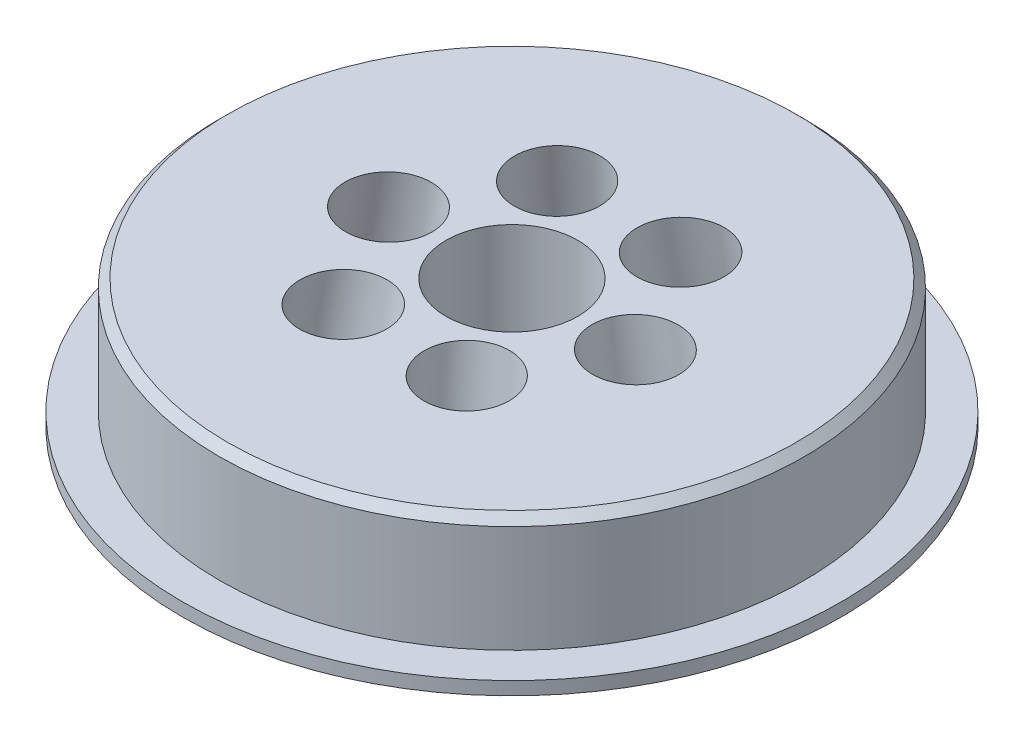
ISO-10303-21;
HEADER;
FILE_DESCRIPTION(('STEP AP214'),'2;1');
FILE_NAME('part.step','',(''),(''),'','','');
FILE_SCHEMA(('AUTOMOTIVE_DESIGN { 1 0 10303 214 1 1 1 1 }'));
ENDSEC;
DATA;
#1=APPLICATION_CONTEXT('core data for automotive mechanical design processes');
#2=APPLICATION_PROTOCOL_DEFINITION('international standard','automotive_design',2000,#1);
#3=PRODUCT_CONTEXT('',#1,'mechanical');
#4=PRODUCT('Part','Part','',(#3));
#5=PRODUCT_RELATED_PRODUCT_CATEGORY('part','',(#4));
#6=PRODUCT_DEFINITION_FORMATION('','',#4);
#7=PRODUCT_DEFINITION_CONTEXT('part definition',#1,'design');
#8=PRODUCT_DEFINITION('design','',#6,#7);
#9=PRODUCT_DEFINITION_SHAPE('','',#8);
#10=(LENGTH_UNIT() NAMED_UNIT(*) SI_UNIT(.MILLI.,.METRE.));
#11=(NAMED_UNIT(*) PLANE_ANGLE_UNIT() SI_UNIT($,.RADIAN.));
#12=(NAMED_UNIT(*) SI_UNIT($,.STERADIAN.) SOLID_ANGLE_UNIT());
#13=UNCERTAINTY_MEASURE_WITH_UNIT(LENGTH_MEASURE(1.E-05),#10,'distance_accuracy_value','');
#14=(GEOMETRIC_REPRESENTATION_CONTEXT(3) GLOBAL_UNCERTAINTY_ASSIGNED_CONTEXT((#13)) GLOBAL_UNIT_ASSIGNED_CONTEXT((#10,
#11,#12)) REPRESENTATION_CONTEXT('',''));
#15=CARTESIAN_POINT('',(0.,0.,0.));
#16=DIRECTION('',(0.,0.,1.));
#17=DIRECTION('',(1.,0.,0.));
#18=AXIS2_PLACEMENT_3D('',#15,#16,#17);
#19=CARTESIAN_POINT('',(-4.74999999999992,-17.9999999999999,0.));
#20=DIRECTION('',(0.,-0.999999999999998,0.));
#21=DIRECTION('',(0.,0.,-0.999999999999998));
#22=AXIS2_PLACEMENT_3D('',#19,#20,#21);
#23=PLANE('',#22);
#24=CARTESIAN_POINT('',(0.,-17.9999999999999,0.));
#25=DIRECTION('',(0.,-0.999999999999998,0.));
#26=DIRECTION('',(0.,0.,-0.999999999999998));
#27=AXIS2_PLACEMENT_3D('',#24,#25,#26);
#28=CIRCLE('',#27,4.24999999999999);
#29=CARTESIAN_POINT('',(0.,-17.9999999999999,4.24999999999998));
#30=VERTEX_POINT('',#29);
#31=EDGE_CURVE('E30',#30,#30,#28,.T.);
#32=ORIENTED_EDGE('',*,*,#31,.T.);
#33=EDGE_LOOP('',(#32));
#34=FACE_BOUND('',#33,.T.);
#35=CARTESIAN_POINT('',(0.,-17.9999999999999,0.));
#36=DIRECTION('',(0.,0.999999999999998,0.));
#37=DIRECTION('',(0.,0.,0.999999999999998));
#38=AXIS2_PLACEMENT_3D('',#35,#36,#37);
#39=CIRCLE('',#38,4.);
#40=CARTESIAN_POINT('',(0.,-17.9999999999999,3.99999999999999));
#41=VERTEX_POINT('',#40);
#42=EDGE_CURVE('E136',#41,#41,#39,.T.);
#43=ORIENTED_EDGE('',*,*,#42,.T.);
#44=EDGE_LOOP('',(#43));
#45=FACE_BOUND('',#44,.T.);
#46=ADVANCED_FACE('F20',(#34,#45),#23,.T.);
#47=CARTESIAN_POINT('',(0.,0.,0.));
#48=DIRECTION('',(0.,0.999999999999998,0.));
#49=DIRECTION('',(0.,0.,0.999999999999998));
#50=AXIS2_PLACEMENT_3D('',#47,#48,#49);
#51=PLANE('',#50);
#52=CARTESIAN_POINT('',(0.,0.,0.));
#53=DIRECTION('',(0.,0.999999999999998,0.));
#54=DIRECTION('',(0.,0.,0.999999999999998));
#55=AXIS2_PLACEMENT_3D('',#52,#53,#54);
#56=CIRCLE('',#55,17.25);
#57=CARTESIAN_POINT('',(0.,0.,17.25));
#58=VERTEX_POINT('',#57);
#59=EDGE_CURVE('E26',#58,#58,#56,.T.);
#60=ORIENTED_EDGE('',*,*,#59,.T.);
#61=EDGE_LOOP('',(#60));
#62=FACE_BOUND('',#61,.T.);
#63=CARTESIAN_POINT('',(-3.74625721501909,0.,6.48870783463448));
#64=DIRECTION('',(0.,0.999999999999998,0.));
#65=DIRECTION('',(-0.500000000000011,0.,0.866025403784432));
#66=AXIS2_PLACEMENT_3D('',#63,#64,#65);
#67=ELLIPSE('',#66,2.6327742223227,2.6);
#68=CARTESIAN_POINT('',(-5.06264432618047,0.,8.76875719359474));
#69=VERTEX_POINT('',#68);
#70=EDGE_CURVE('E217',#69,#69,#67,.T.);
#71=ORIENTED_EDGE('',*,*,#70,.F.);
#72=EDGE_LOOP('',(#71));
#73=FACE_BOUND('',#72,.T.);
#74=CARTESIAN_POINT('',(3.74625721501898,0.,6.48870783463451));
#75=DIRECTION('',(0.,0.999999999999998,0.));
#76=DIRECTION('',(0.499999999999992,0.,0.866025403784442));
#77=AXIS2_PLACEMENT_3D('',#74,#75,#76);
#78=ELLIPSE('',#77,2.6327742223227,2.6);
#79=CARTESIAN_POINT('',(5.06264432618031,0.,8.7687571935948));
#80=VERTEX_POINT('',#79);
#81=EDGE_CURVE('E214',#80,#80,#78,.T.);
#82=ORIENTED_EDGE('',*,*,#81,.F.);
#83=EDGE_LOOP('',(#82));
#84=FACE_BOUND('',#83,.T.);
#85=CARTESIAN_POINT('',(7.49251443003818,0.,0.));
#86=DIRECTION('',(0.,0.999999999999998,0.));
#87=DIRECTION('',(1.,0.,0.));
#88=AXIS2_PLACEMENT_3D('',#85,#86,#87);
#89=ELLIPSE('',#88,2.6327742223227,2.6);
#90=CARTESIAN_POINT('',(10.1252886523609,0.,0.));
#91=VERTEX_POINT('',#90);
#92=EDGE_CURVE('E211',#91,#91,#89,.T.);
#93=ORIENTED_EDGE('',*,*,#92,.F.);
#94=EDGE_LOOP('',(#93));
#95=FACE_BOUND('',#94,.T.);
#96=CARTESIAN_POINT('',(3.74625721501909,0.,-6.48870783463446));
#97=DIRECTION('',(0.,0.999999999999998,0.));
#98=DIRECTION('',(0.500000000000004,0.,-0.866025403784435));
#99=AXIS2_PLACEMENT_3D('',#96,#97,#98);
#100=ELLIPSE('',#99,2.6327742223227,2.6);
#101=CARTESIAN_POINT('',(5.06264432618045,0.,-8.76875719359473));
#102=VERTEX_POINT('',#101);
#103=EDGE_CURVE('E208',#102,#102,#100,.T.);
#104=ORIENTED_EDGE('',*,*,#103,.F.);
#105=EDGE_LOOP('',(#104));
#106=FACE_BOUND('',#105,.T.);
#107=CARTESIAN_POINT('',(-3.74625721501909,0.,-6.48870783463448));
#108=DIRECTION('',(0.,0.999999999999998,0.));
#109=DIRECTION('',(-0.499999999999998,0.,-0.866025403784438));
#110=AXIS2_PLACEMENT_3D('',#107,#108,#109);
#111=ELLIPSE('',#110,2.6327742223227,2.6);
#112=CARTESIAN_POINT('',(-5.06264432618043,0.,-8.76875719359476));
#113=VERTEX_POINT('',#112);
#114=EDGE_CURVE('E205',#113,#113,#111,.T.);
#115=ORIENTED_EDGE('',*,*,#114,.F.);
#116=EDGE_LOOP('',(#115));
#117=FACE_BOUND('',#116,.T.);
#118=CARTESIAN_POINT('',(-7.49251443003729,0.,0.));
#119=DIRECTION('',(0.,0.999999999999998,0.));
#120=DIRECTION('',(-1.,0.,0.));
#121=AXIS2_PLACEMENT_3D('',#118,#119,#120);
#122=ELLIPSE('',#121,2.6327742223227,2.6);
#123=CARTESIAN_POINT('',(-10.12528865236,0.,0.));
#124=VERTEX_POINT('',#123);
#125=EDGE_CURVE('E144',#124,#124,#122,.T.);
#126=ORIENTED_EDGE('',*,*,#125,.F.);
#127=EDGE_LOOP('',(#126));
#128=FACE_BOUND('',#127,.T.);
#129=CARTESIAN_POINT('',(0.,0.,0.));
#130=DIRECTION('',(0.,0.999999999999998,0.));
#131=DIRECTION('',(0.,0.,0.999999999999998));
#132=AXIS2_PLACEMENT_3D('',#129,#130,#131);
#133=CIRCLE('',#132,4.);
#134=CARTESIAN_POINT('',(0.,0.,3.99999999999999));
#135=VERTEX_POINT('',#134);
#136=EDGE_CURVE('E138',#135,#135,#133,.T.);
#137=ORIENTED_EDGE('',*,*,#136,.F.);
#138=EDGE_LOOP('',(#137));
#139=FACE_BOUND('',#138,.T.);
#140=ADVANCED_FACE('F126',(#62,#73,#84,#95,#106,#117,#128,#139),#51,.T.);
#141=CARTESIAN_POINT('',(0.,16.4779705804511,0.));
#142=DIRECTION('',(0.,0.999999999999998,0.));
#143=DIRECTION('',(0.,0.,0.999999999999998));
#144=AXIS2_PLACEMENT_3D('',#141,#142,#143);
#145=CYLINDRICAL_SURFACE('',#144,17.75);
#146=CARTESIAN_POINT('',(0.,-0.500000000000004,0.));
#147=DIRECTION('',(0.,0.999999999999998,0.));
#148=DIRECTION('',(0.,0.,0.999999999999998));
#149=AXIS2_PLACEMENT_3D('',#146,#147,#148);
#150=CIRCLE('',#149,17.75);
#151=CARTESIAN_POINT('',(0.,-0.500000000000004,17.75));
#152=VERTEX_POINT('',#151);
#153=EDGE_CURVE('E10',#152,#152,#150,.F.);
#154=CARTESIAN_POINT('',(0.,-6.99999999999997,0.));
#155=DIRECTION('',(0.,0.999999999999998,0.));
#156=DIRECTION('',(0.,0.,0.999999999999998));
#157=AXIS2_PLACEMENT_3D('',#154,#155,#156);
#158=CIRCLE('',#157,17.75);
#159=CARTESIAN_POINT('',(0.,-6.99999999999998,17.75));
#160=VERTEX_POINT('',#159);
#161=EDGE_CURVE('E160',#160,#160,#158,.T.);
#162=CARTESIAN_POINT('',(0.,-0.500000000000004,17.75));
#163=CARTESIAN_POINT('',(0.,-0.567708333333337,17.75));
#164=CARTESIAN_POINT('',(0.,-0.63541666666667,17.75));
#165=CARTESIAN_POINT('',(0.,-0.770833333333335,17.75));
#166=CARTESIAN_POINT('',(0.,-0.838541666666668,17.75));
#167=CARTESIAN_POINT('',(0.,-0.973958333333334,17.75));
#168=CARTESIAN_POINT('',(0.,-1.04166666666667,17.75));
#169=CARTESIAN_POINT('',(0.,-1.17708333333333,17.75));
#170=CARTESIAN_POINT('',(0.,-1.24479166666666,17.75));
#171=CARTESIAN_POINT('',(0.,-1.38020833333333,17.75));
#172=CARTESIAN_POINT('',(0.,-1.44791666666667,17.75));
#173=CARTESIAN_POINT('',(0.,-1.58333333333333,17.75));
#174=CARTESIAN_POINT('',(0.,-1.65104166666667,17.75));
#175=CARTESIAN_POINT('',(0.,-1.78645833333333,17.75));
#176=CARTESIAN_POINT('',(0.,-1.85416666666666,17.75));
#177=CARTESIAN_POINT('',(0.,-1.98958333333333,17.75));
#178=CARTESIAN_POINT('',(0.,-2.05729166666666,17.75));
#179=CARTESIAN_POINT('',(0.,-2.19270833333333,17.75));
#180=CARTESIAN_POINT('',(0.,-2.26041666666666,17.75));
#181=CARTESIAN_POINT('',(0.,-2.39583333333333,17.75));
#182=CARTESIAN_POINT('',(0.,-2.46354166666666,17.75));
#183=CARTESIAN_POINT('',(0.,-2.59895833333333,17.75));
#184=CARTESIAN_POINT('',(0.,-2.66666666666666,17.75));
#185=CARTESIAN_POINT('',(0.,-2.80208333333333,17.75));
#186=CARTESIAN_POINT('',(0.,-2.86979166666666,17.75));
#187=CARTESIAN_POINT('',(0.,-3.00520833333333,17.75));
#188=CARTESIAN_POINT('',(0.,-3.07291666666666,17.75));
#189=CARTESIAN_POINT('',(0.,-3.20833333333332,17.75));
#190=CARTESIAN_POINT('',(0.,-3.27604166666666,17.75));
#191=CARTESIAN_POINT('',(0.,-3.41145833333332,17.75));
#192=CARTESIAN_POINT('',(0.,-3.47916666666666,17.75));
#193=CARTESIAN_POINT('',(0.,-3.61458333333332,17.75));
#194=CARTESIAN_POINT('',(0.,-3.68229166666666,17.75));
#195=CARTESIAN_POINT('',(0.,-3.81770833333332,17.75));
#196=CARTESIAN_POINT('',(0.,-3.88541666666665,17.75));
#197=CARTESIAN_POINT('',(0.,-4.02083333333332,17.75));
#198=CARTESIAN_POINT('',(0.,-4.08854166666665,17.75));
#199=CARTESIAN_POINT('',(0.,-4.22395833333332,17.75));
#200=CARTESIAN_POINT('',(0.,-4.29166666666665,17.75));
#201=CARTESIAN_POINT('',(0.,-4.42708333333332,17.75));
#202=CARTESIAN_POINT('',(0.,-4.49479166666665,17.75));
#203=CARTESIAN_POINT('',(0.,-4.63020833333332,17.75));
#204=CARTESIAN_POINT('',(0.,-4.69791666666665,17.75));
#205=CARTESIAN_POINT('',(0.,-4.83333333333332,17.75));
#206=CARTESIAN_POINT('',(0.,-4.90104166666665,17.75));
#207=CARTESIAN_POINT('',(0.,-5.03645833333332,17.75));
#208=CARTESIAN_POINT('',(0.,-5.10416666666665,17.75));
#209=CARTESIAN_POINT('',(0.,-5.23958333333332,17.75));
#210=CARTESIAN_POINT('',(0.,-5.30729166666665,17.75));
#211=CARTESIAN_POINT('',(0.,-5.44270833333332,17.75));
#212=CARTESIAN_POINT('',(0.,-5.51041666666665,17.75));
#213=CARTESIAN_POINT('',(0.,-5.64583333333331,17.75));
#214=CARTESIAN_POINT('',(0.,-5.71354166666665,17.75));
#215=CARTESIAN_POINT('',(0.,-5.84895833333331,17.75));
#216=CARTESIAN_POINT('',(0.,-5.91666666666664,17.75));
#217=CARTESIAN_POINT('',(0.,-6.05208333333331,17.75));
#218=CARTESIAN_POINT('',(0.,-6.11979166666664,17.75));
#219=CARTESIAN_POINT('',(0.,-6.25520833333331,17.75));
#220=CARTESIAN_POINT('',(0.,-6.32291666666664,17.75));
#221=CARTESIAN_POINT('',(0.,-6.45833333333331,17.75));
#222=CARTESIAN_POINT('',(0.,-6.52604166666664,17.75));
#223=CARTESIAN_POINT('',(0.,-6.66145833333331,17.75));
#224=CARTESIAN_POINT('',(0.,-6.72916666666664,17.75));
#225=CARTESIAN_POINT('',(0.,-6.86458333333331,17.75));
#226=CARTESIAN_POINT('',(0.,-6.93229166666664,17.75));
#227=CARTESIAN_POINT('',(0.,-6.99999999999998,17.75));
#228=B_SPLINE_CURVE_WITH_KNOTS('',3,(#162,#163,#164,#165,#166,#167,#168,#169,#170,#171,#172,
#173,#174,#175,#176,#177,#178,#179,#180,#181,#182,#183,#184,#185,#186,#187,#188,#189,#190,#191,
#192,#193,#194,#195,#196,#197,#198,#199,#200,#201,#202,#203,#204,#205,#206,#207,#208,#209,#210,
#211,#212,#213,#214,#215,#216,#217,#218,#219,#220,#221,#222,#223,#224,#225,#226,#227),
.UNSPECIFIED.,.F.,.F.,(4,2,2,2,2,2,2,2,2,2,2,2,2,2,2,2,2,2,2,2,2,2,2,2,2,2,2,2,2,2,2,2,4),(0.,
0.203124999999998,0.406249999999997,0.609374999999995,0.812499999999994,1.015625,
1.21874999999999,1.42187499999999,1.62499999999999,1.82812499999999,2.03124999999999,
2.23437499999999,2.43749999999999,2.64062499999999,2.84374999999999,3.04687499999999,
3.24999999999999,3.45312499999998,3.65624999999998,3.85937499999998,4.06249999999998,
4.26562499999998,4.46874999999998,4.67187499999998,4.87499999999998,5.07812499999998,
5.28124999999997,5.48437499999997,5.68749999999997,5.89062499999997,6.09374999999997,
6.29687499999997,6.49999999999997),.UNSPECIFIED.);
#229=EDGE_CURVE('BSEAM131',#152,#160,#228,.T.);
#230=ORIENTED_EDGE('',*,*,#153,.T.);
#231=ORIENTED_EDGE('',*,*,#161,.T.);
#232=ORIENTED_EDGE('',*,*,#229,.T.);
#233=ORIENTED_EDGE('',*,*,#229,.F.);
#234=EDGE_LOOP('',(#230,#232,#231,#233));
#235=FACE_BOUND('',#234,.T.);
#236=ADVANCED_FACE('F131',(#235),#145,.T.);
#237=CARTESIAN_POINT('',(-17.7499999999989,-6.99999999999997,0.));
#238=DIRECTION('',(0.,0.999999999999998,0.));
#239=DIRECTION('',(0.,0.,0.999999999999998));
#240=AXIS2_PLACEMENT_3D('',#237,#238,#239);
#241=PLANE('',#240);
#242=CARTESIAN_POINT('',(0.,-6.99999999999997,0.));
#243=DIRECTION('',(0.,0.999999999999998,0.));
#244=DIRECTION('',(0.,0.,0.999999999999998));
#245=AXIS2_PLACEMENT_3D('',#242,#243,#244);
#246=CIRCLE('',#245,20.);
#247=CARTESIAN_POINT('',(0.,-6.99999999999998,20.));
#248=VERTEX_POINT('',#247);
#249=EDGE_CURVE('E158',#248,#248,#246,.T.);
#250=ORIENTED_EDGE('',*,*,#249,.T.);
#251=EDGE_LOOP('',(#250));
#252=FACE_BOUND('',#251,.T.);
#253=ORIENTED_EDGE('',*,*,#161,.F.);
#254=EDGE_LOOP('',(#253));
#255=FACE_BOUND('',#254,.T.);
#256=ADVANCED_FACE('F180',(#252,#255),#241,.T.);
#257=CARTESIAN_POINT('',(0.,16.4779705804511,0.));
#258=DIRECTION('',(0.,0.999999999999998,0.));
#259=DIRECTION('',(0.,0.,0.999999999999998));
#260=AXIS2_PLACEMENT_3D('',#257,#258,#259);
#261=CYLINDRICAL_SURFACE('',#260,20.);
#262=CARTESIAN_POINT('',(0.,-7.79999999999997,0.));
#263=DIRECTION('',(0.,0.999999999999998,0.));
#264=DIRECTION('',(0.,0.,0.999999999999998));
#265=AXIS2_PLACEMENT_3D('',#262,#263,#264);
#266=CIRCLE('',#265,20.);
#267=CARTESIAN_POINT('',(0.,-7.79999999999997,20.));
#268=VERTEX_POINT('',#267);
#269=EDGE_CURVE('E155',#268,#268,#266,.T.);
#270=CARTESIAN_POINT('',(0.,-7.79999999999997,20.));
#271=CARTESIAN_POINT('',(0.,-7.79166666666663,20.));
#272=CARTESIAN_POINT('',(0.,-7.7833333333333,20.));
#273=CARTESIAN_POINT('',(0.,-7.76666666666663,20.));
#274=CARTESIAN_POINT('',(0.,-7.7583333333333,20.));
#275=CARTESIAN_POINT('',(0.,-7.74166666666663,20.));
#276=CARTESIAN_POINT('',(0.,-7.7333333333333,20.));
#277=CARTESIAN_POINT('',(0.,-7.71666666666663,20.));
#278=CARTESIAN_POINT('',(0.,-7.7083333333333,20.));
#279=CARTESIAN_POINT('',(0.,-7.69166666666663,20.));
#280=CARTESIAN_POINT('',(0.,-7.6833333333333,20.));
#281=CARTESIAN_POINT('',(0.,-7.66666666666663,20.));
#282=CARTESIAN_POINT('',(0.,-7.6583333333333,20.));
#283=CARTESIAN_POINT('',(0.,-7.64166666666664,20.));
#284=CARTESIAN_POINT('',(0.,-7.6333333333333,20.));
#285=CARTESIAN_POINT('',(0.,-7.61666666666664,20.));
#286=CARTESIAN_POINT('',(0.,-7.6083333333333,20.));
#287=CARTESIAN_POINT('',(0.,-7.59166666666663,20.));
#288=CARTESIAN_POINT('',(0.,-7.5833333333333,20.));
#289=CARTESIAN_POINT('',(0.,-7.56666666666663,20.));
#290=CARTESIAN_POINT('',(0.,-7.5583333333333,20.));
#291=CARTESIAN_POINT('',(0.,-7.54166666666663,20.));
#292=CARTESIAN_POINT('',(0.,-7.5333333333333,20.));
#293=CARTESIAN_POINT('',(0.,-7.51666666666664,20.));
#294=CARTESIAN_POINT('',(0.,-7.5083333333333,20.));
#295=CARTESIAN_POINT('',(0.,-7.49166666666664,20.));
#296=CARTESIAN_POINT('',(0.,-7.4833333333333,20.));
#297=CARTESIAN_POINT('',(0.,-7.46666666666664,20.));
#298=CARTESIAN_POINT('',(0.,-7.4583333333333,20.));
#299=CARTESIAN_POINT('',(0.,-7.44166666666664,20.));
#300=CARTESIAN_POINT('',(0.,-7.4333333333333,20.));
#301=CARTESIAN_POINT('',(0.,-7.41666666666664,20.));
#302=CARTESIAN_POINT('',(0.,-7.4083333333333,20.));
#303=CARTESIAN_POINT('',(0.,-7.39166666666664,20.));
#304=CARTESIAN_POINT('',(0.,-7.3833333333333,20.));
#305=CARTESIAN_POINT('',(0.,-7.36666666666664,20.));
#306=CARTESIAN_POINT('',(0.,-7.3583333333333,20.));
#307=CARTESIAN_POINT('',(0.,-7.34166666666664,20.));
#308=CARTESIAN_POINT('',(0.,-7.33333333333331,20.));
#309=CARTESIAN_POINT('',(0.,-7.31666666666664,20.));
#310=CARTESIAN_POINT('',(0.,-7.30833333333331,20.));
#311=CARTESIAN_POINT('',(0.,-7.29166666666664,20.));
#312=CARTESIAN_POINT('',(0.,-7.28333333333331,20.));
#313=CARTESIAN_POINT('',(0.,-7.26666666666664,20.));
#314=CARTESIAN_POINT('',(0.,-7.25833333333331,20.));
#315=CARTESIAN_POINT('',(0.,-7.24166666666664,20.));
#316=CARTESIAN_POINT('',(0.,-7.23333333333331,20.));
#317=CARTESIAN_POINT('',(0.,-7.21666666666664,20.));
#318=CARTESIAN_POINT('',(0.,-7.20833333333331,20.));
#319=CARTESIAN_POINT('',(0.,-7.19166666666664,20.));
#320=CARTESIAN_POINT('',(0.,-7.18333333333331,20.));
#321=CARTESIAN_POINT('',(0.,-7.16666666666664,20.));
#322=CARTESIAN_POINT('',(0.,-7.15833333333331,20.));
#323=CARTESIAN_POINT('',(0.,-7.14166666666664,20.));
#324=CARTESIAN_POINT('',(0.,-7.13333333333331,20.));
#325=CARTESIAN_POINT('',(0.,-7.11666666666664,20.));
#326=CARTESIAN_POINT('',(0.,-7.10833333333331,20.));
#327=CARTESIAN_POINT('',(0.,-7.09166666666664,20.));
#328=CARTESIAN_POINT('',(0.,-7.08333333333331,20.));
#329=CARTESIAN_POINT('',(0.,-7.06666666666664,20.));
#330=CARTESIAN_POINT('',(0.,-7.05833333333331,20.));
#331=CARTESIAN_POINT('',(0.,-7.04166666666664,20.));
#332=CARTESIAN_POINT('',(0.,-7.03333333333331,20.));
#333=CARTESIAN_POINT('',(0.,-7.01666666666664,20.));
#334=CARTESIAN_POINT('',(0.,-7.00833333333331,20.));
#335=CARTESIAN_POINT('',(0.,-6.99999999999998,20.));
#336=B_SPLINE_CURVE_WITH_KNOTS('',3,(#270,#271,#272,#273,#274,#275,#276,#277,#278,#279,#280,
#281,#282,#283,#284,#285,#286,#287,#288,#289,#290,#291,#292,#293,#294,#295,#296,#297,#298,#299,
#300,#301,#302,#303,#304,#305,#306,#307,#308,#309,#310,#311,#312,#313,#314,#315,#316,#317,#318,
#319,#320,#321,#322,#323,#324,#325,#326,#327,#328,#329,#330,#331,#332,#333,#334,#335),
.UNSPECIFIED.,.F.,.F.,(4,2,2,2,2,2,2,2,2,2,2,2,2,2,2,2,2,2,2,2,2,2,2,2,2,2,2,2,2,2,2,2,4),(0.,
0.0250000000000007,0.0500000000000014,0.0749999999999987,0.0999999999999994,0.125,
0.149999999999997,0.174999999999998,0.199999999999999,0.225,0.25,0.274999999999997,
0.299999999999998,0.324999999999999,0.349999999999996,0.374999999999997,0.399999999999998,
0.424999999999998,0.449999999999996,0.474999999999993,0.499999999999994,0.524999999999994,
0.549999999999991,0.574999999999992,0.599999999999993,0.624999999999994,0.649999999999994,
0.674999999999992,0.699999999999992,0.724999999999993,0.74999999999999,0.774999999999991,
0.799999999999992),.UNSPECIFIED.);
#337=EDGE_CURVE('BSEAM175',#268,#248,#336,.T.);
#338=ORIENTED_EDGE('',*,*,#269,.T.);
#339=ORIENTED_EDGE('',*,*,#249,.F.);
#340=ORIENTED_EDGE('',*,*,#337,.T.);
#341=ORIENTED_EDGE('',*,*,#337,.F.);
#342=EDGE_LOOP('',(#338,#340,#339,#341));
#343=FACE_BOUND('',#342,.T.);
#344=ADVANCED_FACE('F175',(#343),#261,.T.);
#345=CARTESIAN_POINT('',(-12.499999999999,-7.79999999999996,0.));
#346=DIRECTION('',(0.,-0.999999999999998,0.));
#347=DIRECTION('',(0.,0.,-0.999999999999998));
#348=AXIS2_PLACEMENT_3D('',#345,#346,#347);
#349=PLANE('',#348);
#350=CARTESIAN_POINT('',(0.,-7.79999999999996,0.));
#351=DIRECTION('',(0.,0.999999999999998,0.));
#352=DIRECTION('',(0.,0.,0.999999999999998));
#353=AXIS2_PLACEMENT_3D('',#350,#351,#352);
#354=CIRCLE('',#353,12.5);
#355=CARTESIAN_POINT('',(0.,-7.79999999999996,12.5));
#356=VERTEX_POINT('',#355);
#357=EDGE_CURVE('E152',#356,#356,#354,.T.);
#358=ORIENTED_EDGE('',*,*,#357,.T.);
#359=EDGE_LOOP('',(#358));
#360=FACE_BOUND('',#359,.T.);
#361=ORIENTED_EDGE('',*,*,#269,.F.);
#362=EDGE_LOOP('',(#361));
#363=FACE_BOUND('',#362,.T.);
#364=ADVANCED_FACE('F121',(#360,#363),#349,.T.);
#365=CARTESIAN_POINT('',(0.,-7.79999999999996,0.));
#366=DIRECTION('',(0.,0.999999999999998,0.));
#367=DIRECTION('',(0.,0.,0.999999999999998));
#368=AXIS2_PLACEMENT_3D('',#365,#366,#367);
#369=CONICAL_SURFACE('',#368,12.5,1.41284402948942);
#370=CARTESIAN_POINT('',(-6.25459463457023,-8.43141963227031,5.8085587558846));
#371=CARTESIAN_POINT('',(-6.15244926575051,-8.45436949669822,5.70681701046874));
#372=CARTESIAN_POINT('',(-6.04153272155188,-8.47740530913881,5.6137508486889));
#373=CARTESIAN_POINT('',(-5.80533014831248,-8.52295329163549,5.4477079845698));
#374=CARTESIAN_POINT('',(-5.68002728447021,-8.54546481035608,5.37475516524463));
#375=CARTESIAN_POINT('',(-5.41873468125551,-8.58914674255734,5.25110760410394));
#376=CARTESIAN_POINT('',(-5.28275047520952,-8.6103178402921,5.20040142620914));
#377=CARTESIAN_POINT('',(-5.00391442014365,-8.65044394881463,5.12260521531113));
#378=CARTESIAN_POINT('',(-4.86106418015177,-8.66939947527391,5.09550967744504));
#379=CARTESIAN_POINT('',(-4.57233425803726,-8.70417923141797,5.06560373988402));
#380=CARTESIAN_POINT('',(-4.42645192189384,-8.72000057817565,5.06281559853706));
#381=CARTESIAN_POINT('',(-4.13586950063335,-8.74756556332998,5.08160159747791));
#382=CARTESIAN_POINT('',(-3.99116945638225,-8.75930906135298,5.10317657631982));
#383=CARTESIAN_POINT('',(-3.70703947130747,-8.77792564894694,5.17002141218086));
#384=CARTESIAN_POINT('',(-3.56760895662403,-8.78479927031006,5.215288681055));
#385=CARTESIAN_POINT('',(-3.29794880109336,-8.79316569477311,5.32819360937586));
#386=CARTESIAN_POINT('',(-3.16771898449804,-8.79465860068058,5.3958308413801));
#387=CARTESIAN_POINT('',(-2.92040766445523,-8.79214976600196,5.5513872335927));
#388=CARTESIAN_POINT('',(-2.80330125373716,-8.78815863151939,5.63926697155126));
#389=CARTESIAN_POINT('',(-2.58528197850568,-8.77500686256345,5.83290737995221));
#390=CARTESIAN_POINT('',(-2.48436924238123,-8.76584618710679,5.93866819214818));
#391=CARTESIAN_POINT('',(-2.30159050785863,-8.74300519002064,6.16515798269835));
#392=CARTESIAN_POINT('',(-2.21973007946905,-8.72932354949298,6.28589132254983));
#393=CARTESIAN_POINT('',(-2.07743429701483,-8.698305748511,6.53895759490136));
#394=CARTESIAN_POINT('',(-2.01699914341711,-8.68096955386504,6.67129063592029));
#395=CARTESIAN_POINT('',(-1.91920376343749,-8.64354729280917,6.94413859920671));
#396=CARTESIAN_POINT('',(-1.88188606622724,-8.62345624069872,7.08466808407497));
#397=CARTESIAN_POINT('',(-1.83159204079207,-8.58146947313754,7.3697556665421));
#398=CARTESIAN_POINT('',(-1.81861562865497,-8.5595737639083,7.51431375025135));
#399=CARTESIAN_POINT('',(-1.81739876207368,-8.51482637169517,7.80334521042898));
#400=CARTESIAN_POINT('',(-1.82915136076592,-8.49197495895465,7.94781859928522));
#401=CARTESIAN_POINT('',(-1.87705907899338,-8.44605239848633,8.23262504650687));
#402=CARTESIAN_POINT('',(-1.91321408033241,-8.42298125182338,8.37295812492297));
#403=CARTESIAN_POINT('',(-2.00884845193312,-8.37728302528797,8.64534304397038));
#404=CARTESIAN_POINT('',(-2.06830314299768,-8.35465550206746,8.77740347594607));
#405=CARTESIAN_POINT('',(-2.20884096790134,-8.31036191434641,9.029642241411));
#406=CARTESIAN_POINT('',(-2.28992410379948,-8.28869584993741,9.14982057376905));
#407=CARTESIAN_POINT('',(-2.47140813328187,-8.24678183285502,9.37487377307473));
#408=CARTESIAN_POINT('',(-2.57181016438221,-8.22653396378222,9.47974773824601));
#409=CARTESIAN_POINT('',(-2.78906559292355,-8.18784152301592,9.67119057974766));
#410=CARTESIAN_POINT('',(-2.9059190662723,-8.16939695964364,9.75775937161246));
#411=CARTESIAN_POINT('',(-3.15285081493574,-8.13461653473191,9.91017807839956));
#412=CARTESIAN_POINT('',(-3.28293963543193,-8.11828237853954,9.97601129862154));
#413=CARTESIAN_POINT('',(-3.55256152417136,-8.08800338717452,10.0849727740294));
#414=CARTESIAN_POINT('',(-3.692094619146,-8.0740585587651,10.1281009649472));
#415=CARTESIAN_POINT('',(-3.97670043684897,-8.04876488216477,10.1904174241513));
#416=CARTESIAN_POINT('',(-4.12177558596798,-8.03741718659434,10.2095950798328));
#417=CARTESIAN_POINT('',(-4.4132783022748,-8.01749143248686,10.223405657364));
#418=CARTESIAN_POINT('',(-4.55970586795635,-8.00891337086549,10.2180386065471));
#419=CARTESIAN_POINT('',(-4.84970116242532,-7.99465059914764,10.1828958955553));
#420=CARTESIAN_POINT('',(-4.99326974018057,-7.98896501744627,10.153127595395));
#421=CARTESIAN_POINT('',(-5.273506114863,-7.98056232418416,10.0700218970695));
#422=CARTESIAN_POINT('',(-5.41017394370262,-7.97784519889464,10.0166846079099));
#423=CARTESIAN_POINT('',(-5.67264589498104,-7.97541741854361,9.88798600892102));
#424=CARTESIAN_POINT('',(-5.79845611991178,-7.97570506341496,9.81263717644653));
#425=CARTESIAN_POINT('',(-6.03572739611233,-7.97927878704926,9.64204452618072));
#426=CARTESIAN_POINT('',(-6.14718844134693,-7.98256486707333,9.5468007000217));
#427=CARTESIAN_POINT('',(-6.35258666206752,-7.99208953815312,9.33914696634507));
#428=CARTESIAN_POINT('',(-6.44652650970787,-7.99832767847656,9.22673968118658));
#429=CARTESIAN_POINT('',(-6.61425013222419,-8.01366951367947,8.98795150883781));
#430=CARTESIAN_POINT('',(-6.6880338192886,-8.02277322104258,8.86157056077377));
#431=CARTESIAN_POINT('',(-6.81339664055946,-8.04372155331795,8.59837717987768));
#432=CARTESIAN_POINT('',(-6.86496570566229,-8.05556741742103,8.46156004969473));
#433=CARTESIAN_POINT('',(-6.94440367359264,-8.08182339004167,8.18145032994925));
#434=CARTESIAN_POINT('',(-6.97227339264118,-8.09623341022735,8.03815796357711));
#435=CARTESIAN_POINT('',(-7.003549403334,-8.12740292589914,7.74911833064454));
#436=CARTESIAN_POINT('',(-7.00694549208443,-8.1441633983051,7.60337006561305));
#437=CARTESIAN_POINT('',(-6.98915943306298,-8.17976079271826,7.31359746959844));
#438=CARTESIAN_POINT('',(-6.96797129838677,-8.19859821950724,7.16957356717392));
#439=CARTESIAN_POINT('',(-6.90161825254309,-8.23801877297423,6.88736050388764));
#440=CARTESIAN_POINT('',(-6.85644387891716,-8.25860258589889,6.7491736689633));
#441=CARTESIAN_POINT('',(-6.74343002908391,-8.30109642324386,6.48275642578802));
#442=CARTESIAN_POINT('',(-6.67561750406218,-8.32300484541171,6.35451440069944));
#443=CARTESIAN_POINT('',(-6.54817840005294,-8.35943078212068,6.15639261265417));
#444=CARTESIAN_POINT('',(-6.49473563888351,-8.37369854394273,6.08241364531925));
#445=CARTESIAN_POINT('',(-6.38022841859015,-8.40243930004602,5.94065381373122));
#446=CARTESIAN_POINT('',(-6.31916396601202,-8.41691229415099,5.87287294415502));
#447=CARTESIAN_POINT('',(-6.25459463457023,-8.43141963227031,5.8085587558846));
#448=B_SPLINE_CURVE_WITH_KNOTS('',3,(#370,#371,#372,#373,#374,#375,#376,#377,#378,#379,#380,
#381,#382,#383,#384,#385,#386,#387,#388,#389,#390,#391,#392,#393,#394,#395,#396,#397,#398,#399,
#400,#401,#402,#403,#404,#405,#406,#407,#408,#409,#410,#411,#412,#413,#414,#415,#416,#417,#418,
#419,#420,#421,#422,#423,#424,#425,#426,#427,#428,#429,#430,#431,#432,#433,#434,#435,#436,#437,
#438,#439,#440,#441,#442,#443,#444,#445,#446,#447),.UNSPECIFIED.,.T.,.F.,(4,2,2,2,2,2,2,2,2,2,2,
2,2,2,2,2,2,2,2,2,2,2,2,2,2,2,2,2,2,2,2,2,2,2,2,2,2,2,4),(0.,0.437619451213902,
0.875756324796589,1.31366770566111,1.75147695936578,2.18968707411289,2.6279122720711,
3.06608960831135,3.50425857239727,3.94158131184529,4.37890751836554,4.81636141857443,
5.25381941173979,5.69207982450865,6.13033872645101,6.5684745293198,7.00660821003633,
7.44427906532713,7.88194996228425,8.31964663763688,8.75734533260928,9.19539553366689,
9.63344697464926,10.071692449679,10.5099374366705,10.9480502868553,11.3861611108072,
11.8240240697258,12.2618872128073,12.6996835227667,13.1374817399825,13.5754781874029,
14.0134595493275,14.4516234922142,14.889894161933,15.3283378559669,15.7662614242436,
16.0428948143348,16.3195279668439),.UNSPECIFIED.);
#449=CARTESIAN_POINT('',(-6.25459463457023,-8.43141963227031,5.8085587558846));
#450=VERTEX_POINT('',#449);
#451=EDGE_CURVE('E39',#450,#450,#448,.T.);
#452=ORIENTED_EDGE('',*,*,#451,.F.);
#453=EDGE_LOOP('',(#452));
#454=FACE_BOUND('',#453,.T.);
#455=CARTESIAN_POINT('',(2.2084016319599,-8.72594550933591,6.31143649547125));
#456=CARTESIAN_POINT('',(2.28518900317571,-8.7404284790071,6.1882300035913));
#457=CARTESIAN_POINT('',(2.37244202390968,-8.75297386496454,6.07119595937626));
#458=CARTESIAN_POINT('',(2.56538695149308,-8.77335065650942,5.85282267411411));
#459=CARTESIAN_POINT('',(2.67110007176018,-8.78117659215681,5.75150174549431));
#460=CARTESIAN_POINT('',(2.89785913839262,-8.79152363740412,5.56752787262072));
#461=CARTESIAN_POINT('',(3.01889906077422,-8.79404682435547,5.48486762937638));
#462=CARTESIAN_POINT('',(3.27285357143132,-8.79359669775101,5.34053707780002));
#463=CARTESIAN_POINT('',(3.40576525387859,-8.79062472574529,5.27886165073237));
#464=CARTESIAN_POINT('',(3.67959221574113,-8.7794227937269,5.17828477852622));
#465=CARTESIAN_POINT('',(3.82049992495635,-8.77119773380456,5.13936217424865));
#466=CARTESIAN_POINT('',(4.10647796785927,-8.75009032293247,5.08534225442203));
#467=CARTESIAN_POINT('',(4.25154851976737,-8.73720772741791,5.07024619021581));
#468=CARTESIAN_POINT('',(4.5420027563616,-8.70759821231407,5.06436059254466));
#469=CARTESIAN_POINT('',(4.68738659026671,-8.69086575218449,5.07360629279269));
#470=CARTESIAN_POINT('',(4.97418869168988,-8.65450320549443,5.11627985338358));
#471=CARTESIAN_POINT('',(5.11560695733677,-8.63487311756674,5.14970772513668));
#472=CARTESIAN_POINT('',(5.39066816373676,-8.59361935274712,5.23990915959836));
#473=CARTESIAN_POINT('',(5.5243020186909,-8.57199341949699,5.29670940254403));
#474=CARTESIAN_POINT('',(5.7798395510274,-8.52762741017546,5.4320864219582));
#475=CARTESIAN_POINT('',(5.90174330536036,-8.50488734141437,5.51066305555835));
#476=CARTESIAN_POINT('',(6.13025127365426,-8.45907676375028,5.68729709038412));
#477=CARTESIAN_POINT('',(6.23686967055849,-8.43600658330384,5.7853362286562));
#478=CARTESIAN_POINT('',(6.43190863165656,-8.39017257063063,5.99815758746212));
#479=CARTESIAN_POINT('',(6.52032924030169,-8.36740873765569,6.11293976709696));
#480=CARTESIAN_POINT('',(6.67639827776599,-8.32276367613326,6.35588721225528));
#481=CARTESIAN_POINT('',(6.74406108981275,-8.3008818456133,6.48404312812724));
#482=CARTESIAN_POINT('',(6.85677076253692,-8.25845675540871,6.75014714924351));
#483=CARTESIAN_POINT('',(6.90181757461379,-8.23791349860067,6.88809527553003));
#484=CARTESIAN_POINT('',(6.96802571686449,-8.19855269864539,7.16991841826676));
#485=CARTESIAN_POINT('',(6.98917523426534,-8.17973601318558,7.31379632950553));
#486=CARTESIAN_POINT('',(7.00693831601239,-8.14417091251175,7.60331175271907));
#487=CARTESIAN_POINT('',(7.00355176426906,-8.12742250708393,7.74894927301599));
#488=CARTESIAN_POINT('',(6.97231238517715,-8.09625506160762,8.03794467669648));
#489=CARTESIAN_POINT('',(6.94444078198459,-8.08183781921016,8.18130072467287));
#490=CARTESIAN_POINT('',(6.86498000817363,-8.05556998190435,8.46152836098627));
#491=CARTESIAN_POINT('',(6.81339081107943,-8.04371938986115,8.59839994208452));
#492=CARTESIAN_POINT('',(6.68793373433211,-8.02275768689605,8.86177015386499));
#493=CARTESIAN_POINT('',(6.61406297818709,-8.01364692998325,8.98826744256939));
#494=CARTESIAN_POINT('',(6.44612823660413,-7.99829673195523,9.22725704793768));
#495=CARTESIAN_POINT('',(6.3520643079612,-7.99205728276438,9.33974940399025));
#496=CARTESIAN_POINT('',(6.14645692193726,-7.98253902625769,9.54746546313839));
#497=CARTESIAN_POINT('',(6.03492217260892,-7.97925874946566,9.64269771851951));
#498=CARTESIAN_POINT('',(5.79750252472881,-7.9756986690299,9.81324798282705));
#499=CARTESIAN_POINT('',(5.67161767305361,-7.97541885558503,9.8885660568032));
#500=CARTESIAN_POINT('',(5.40913548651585,-7.97786294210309,10.0171173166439));
#501=CARTESIAN_POINT('',(5.27254313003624,-7.98058545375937,10.0703606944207));
#502=CARTESIAN_POINT('',(4.99247621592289,-7.98899459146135,10.1533093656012));
#503=CARTESIAN_POINT('',(4.84900165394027,-7.9946812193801,10.1830146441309));
#504=CARTESIAN_POINT('',(4.55923223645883,-8.00894046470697,10.2180618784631));
#505=CARTESIAN_POINT('',(4.41293707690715,-8.01751339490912,10.2234011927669));
#506=CARTESIAN_POINT('',(4.12169863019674,-8.03742381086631,10.2095797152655));
#507=CARTESIAN_POINT('',(3.9767553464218,-8.04876130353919,10.1904188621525));
#508=CARTESIAN_POINT('',(3.69225897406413,-8.07404265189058,10.1281475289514));
#509=CARTESIAN_POINT('',(3.55270892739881,-8.08798795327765,10.0850237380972));
#510=CARTESIAN_POINT('',(3.28305305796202,-8.11826852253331,9.97606573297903));
#511=CARTESIAN_POINT('',(3.15294727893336,-8.13460380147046,9.91023141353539));
#512=CARTESIAN_POINT('',(2.90584185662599,-8.16940698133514,9.75771791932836));
#513=CARTESIAN_POINT('',(2.78884670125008,-8.18787560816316,9.67103163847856));
#514=CARTESIAN_POINT('',(2.57135221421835,-8.22662043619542,9.47931014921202));
#515=CARTESIAN_POINT('',(2.47085288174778,-8.24689663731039,9.37427494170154));
#516=CARTESIAN_POINT('',(2.28925775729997,-8.28886326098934,9.14890395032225));
#517=CARTESIAN_POINT('',(2.20815470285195,-8.31055315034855,9.02857391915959));
#518=CARTESIAN_POINT('',(2.06762761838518,-8.35489370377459,8.77602605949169));
#519=CARTESIAN_POINT('',(2.00820262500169,-8.37754432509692,8.64380875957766));
#520=CARTESIAN_POINT('',(1.91276923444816,-8.4232416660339,8.37138243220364));
#521=CARTESIAN_POINT('',(1.87673945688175,-8.44628800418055,8.23118082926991));
#522=CARTESIAN_POINT('',(1.82902737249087,-8.49216524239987,7.94662132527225));
#523=CARTESIAN_POINT('',(1.81735091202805,-8.51499608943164,7.80226243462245));
#524=CARTESIAN_POINT('',(1.81867194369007,-8.5597013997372,7.51347576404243));
#525=CARTESIAN_POINT('',(1.83167746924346,-8.58157554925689,7.36904797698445));
#526=CARTESIAN_POINT('',(1.88198386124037,-8.6235030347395,7.08433777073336));
#527=CARTESIAN_POINT('',(1.91925645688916,-8.64355845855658,6.94405072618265));
#528=CARTESIAN_POINT('',(1.99908295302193,-8.67411947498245,6.72123906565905));
#529=CARTESIAN_POINT('',(2.03476085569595,-8.68544158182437,6.63629712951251));
#530=CARTESIAN_POINT('',(2.11501701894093,-8.70675188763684,6.47055107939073));
#531=CARTESIAN_POINT('',(2.15959530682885,-8.71674008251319,6.38974697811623));
#532=CARTESIAN_POINT('',(2.2084016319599,-8.72594550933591,6.31143649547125));
#533=B_SPLINE_CURVE_WITH_KNOTS('',3,(#455,#456,#457,#458,#459,#460,#461,#462,#463,#464,#465,
#466,#467,#468,#469,#470,#471,#472,#473,#474,#475,#476,#477,#478,#479,#480,#481,#482,#483,#484,
#485,#486,#487,#488,#489,#490,#491,#492,#493,#494,#495,#496,#497,#498,#499,#500,#501,#502,#503,
#504,#505,#506,#507,#508,#509,#510,#511,#512,#513,#514,#515,#516,#517,#518,#519,#520,#521,#522,
#523,#524,#525,#526,#527,#528,#529,#530,#531,#532),.UNSPECIFIED.,.T.,.F.,(4,2,2,2,2,2,2,2,2,2,2,
2,2,2,2,2,2,2,2,2,2,2,2,2,2,2,2,2,2,2,2,2,2,2,2,2,2,2,4),(0.,0.437353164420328,
0.875212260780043,1.31289979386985,1.75048048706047,2.18765359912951,2.62484967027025,
3.0626789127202,3.50050836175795,3.93883899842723,4.37716675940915,4.81508513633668,
5.25300244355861,5.69061562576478,6.12822974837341,6.566060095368,7.00389251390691,
7.44206096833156,7.88022991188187,8.31845544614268,8.75667974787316,9.19468631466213,
9.63269145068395,10.0704941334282,10.5082970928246,10.9461475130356,11.3839990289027,
11.8220940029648,12.260191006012,12.6984375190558,13.1366840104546,13.5747661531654,
14.0128288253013,14.4504905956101,14.8882574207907,15.3261667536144,15.7635668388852,
16.041549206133,16.3195324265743),.UNSPECIFIED.);
#534=CARTESIAN_POINT('',(2.2084016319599,-8.72594550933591,6.31143649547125));
#535=VERTEX_POINT('',#534);
#536=EDGE_CURVE('E46',#535,#535,#533,.T.);
#537=ORIENTED_EDGE('',*,*,#536,.F.);
#538=EDGE_LOOP('',(#537));
#539=FACE_BOUND('',#538,.T.);
#540=CARTESIAN_POINT('',(7.05388693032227,-8.62801068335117,-1.88540408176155));
#541=CARTESIAN_POINT('',(7.15784460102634,-8.60788186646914,-1.98588793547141));
#542=CARTESIAN_POINT('',(7.27029390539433,-8.5866529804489,-2.07751708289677));
#543=CARTESIAN_POINT('',(7.50901935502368,-8.54288064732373,-2.24036468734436));
#544=CARTESIAN_POINT('',(7.63531149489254,-8.52033569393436,-2.31155918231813));
#545=CARTESIAN_POINT('',(7.89804183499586,-8.47473830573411,-2.4313915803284));
#546=CARTESIAN_POINT('',(8.03447567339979,-8.45168609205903,-2.48003911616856));
#547=CARTESIAN_POINT('',(8.31361911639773,-8.40575362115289,-2.55341188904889));
#548=CARTESIAN_POINT('',(8.45632719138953,-8.38287332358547,-2.57814292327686));
#549=CARTESIAN_POINT('',(8.74392036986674,-8.33787024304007,-2.60299798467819));
#550=CARTESIAN_POINT('',(8.88880444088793,-8.31574711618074,-2.60313333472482));
#551=CARTESIAN_POINT('',(9.17668697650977,-8.27273816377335,-2.57882360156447));
#552=CARTESIAN_POINT('',(9.31968536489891,-8.25185238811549,-2.5543775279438));
#553=CARTESIAN_POINT('',(9.59976289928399,-8.21172487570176,-2.48158818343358));
#554=CARTESIAN_POINT('',(9.73683984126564,-8.19248374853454,-2.43323609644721));
#555=CARTESIAN_POINT('',(10.0011055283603,-8.15599950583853,-2.31400477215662));
#556=CARTESIAN_POINT('',(10.128294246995,-8.13875639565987,-2.24312547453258));
#557=CARTESIAN_POINT('',(10.3692489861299,-8.10654086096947,-2.08078323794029));
#558=CARTESIAN_POINT('',(10.4830042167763,-8.09157025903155,-1.98930392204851));
#559=CARTESIAN_POINT('',(10.6937189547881,-8.06414930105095,-1.78838659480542));
#560=CARTESIAN_POINT('',(10.7906784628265,-8.05169894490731,-1.67894858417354));
#561=CARTESIAN_POINT('',(10.9650428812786,-8.029500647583,-1.44518904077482));
#562=CARTESIAN_POINT('',(11.0424434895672,-8.01975330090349,-1.32086424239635));
#563=CARTESIAN_POINT('',(11.1754389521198,-8.00310436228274,-1.06087744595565));
#564=CARTESIAN_POINT('',(11.2310338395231,-7.99620276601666,-0.925215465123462));
#565=CARTESIAN_POINT('',(11.3187981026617,-7.98534438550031,-0.646470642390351));
#566=CARTESIAN_POINT('',(11.3509780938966,-7.98138626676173,-0.503391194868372));
#567=CARTESIAN_POINT('',(11.3910269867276,-7.97646429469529,-0.213819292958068));
#568=CARTESIAN_POINT('',(11.398895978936,-7.97550043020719,-0.0673268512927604));
#569=CARTESIAN_POINT('',(11.3900985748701,-7.97657987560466,0.224834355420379));
#570=CARTESIAN_POINT('',(11.3734444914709,-7.97862167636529,0.370503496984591));
#571=CARTESIAN_POINT('',(11.3161028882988,-7.98568169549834,0.656957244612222));
#572=CARTESIAN_POINT('',(11.2754153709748,-7.99069991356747,0.797741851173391));
#573=CARTESIAN_POINT('',(11.17117502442,-8.00364358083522,1.07043772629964));
#574=CARTESIAN_POINT('',(11.1076213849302,-8.01156913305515,1.20234868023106));
#575=CARTESIAN_POINT('',(10.9594733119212,-8.03021592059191,1.4535542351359));
#576=CARTESIAN_POINT('',(10.8748788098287,-8.04093716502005,1.57284879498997));
#577=CARTESIAN_POINT('',(10.6870222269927,-8.06502674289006,1.79550378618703));
#578=CARTESIAN_POINT('',(10.5837502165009,-8.07839648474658,1.89885568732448));
#579=CARTESIAN_POINT('',(10.3615251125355,-8.10757815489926,2.0866214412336));
#580=CARTESIAN_POINT('',(10.2425719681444,-8.12339009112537,2.17103523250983));
#581=CARTESIAN_POINT('',(9.99233519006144,-8.15721181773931,2.31856178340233));
#582=CARTESIAN_POINT('',(9.86104659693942,-8.17522249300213,2.38166592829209));
#583=CARTESIAN_POINT('',(9.58993508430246,-8.21312963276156,2.48473228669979));
#584=CARTESIAN_POINT('',(9.45011217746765,-8.23302609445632,2.52469453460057));
#585=CARTESIAN_POINT('',(9.16597536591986,-8.27432859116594,2.5803288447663));
#586=CARTESIAN_POINT('',(9.02166284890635,-8.29573416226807,2.5960083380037));
#587=CARTESIAN_POINT('',(8.73263287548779,-8.33961857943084,2.60265006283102));
#588=CARTESIAN_POINT('',(8.58791542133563,-8.36209741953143,2.59361243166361));
#589=CARTESIAN_POINT('',(8.30232635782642,-8.40758564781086,2.55109256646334));
#590=CARTESIAN_POINT('',(8.16145171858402,-8.43059458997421,2.51763020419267));
#591=CARTESIAN_POINT('',(7.88743393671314,-8.47654471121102,2.42723642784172));
#592=CARTESIAN_POINT('',(7.75429076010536,-8.49948589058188,2.37030511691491));
#593=CARTESIAN_POINT('',(7.49953733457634,-8.54457759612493,2.23461452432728));
#594=CARTESIAN_POINT('',(7.37792396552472,-8.56672833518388,2.15586117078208));
#595=CARTESIAN_POINT('',(7.14959781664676,-8.60942853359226,1.97875743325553));
#596=CARTESIAN_POINT('',(7.04288519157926,-8.62997797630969,1.88040684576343));
#597=CARTESIAN_POINT('',(6.8472300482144,-8.66859103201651,1.66679341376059));
#598=CARTESIAN_POINT('',(6.75830422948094,-8.68665230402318,1.55151485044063));
#599=CARTESIAN_POINT('',(6.60079105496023,-8.71932187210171,1.30737233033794));
#600=CARTESIAN_POINT('',(6.53220386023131,-8.73393014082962,1.17850826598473));
#601=CARTESIAN_POINT('',(6.41719990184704,-8.75880570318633,0.910749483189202));
#602=CARTESIAN_POINT('',(6.37079748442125,-8.76907018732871,0.771848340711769));
#603=CARTESIAN_POINT('',(6.30149168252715,-8.78452573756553,0.488037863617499));
#604=CARTESIAN_POINT('',(6.27858696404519,-8.78971709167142,0.343128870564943));
#605=CARTESIAN_POINT('',(6.25691103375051,-8.79462778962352,0.0516780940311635));
#606=CARTESIAN_POINT('',(6.2580982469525,-8.79435656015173,-0.0948604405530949));
#607=CARTESIAN_POINT('',(6.28447833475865,-8.78838514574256,-0.385687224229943));
#608=CARTESIAN_POINT('',(6.30967705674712,-8.78268363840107,-0.529974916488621));
#609=CARTESIAN_POINT('',(6.3833813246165,-8.7662856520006,-0.812098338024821));
#610=CARTESIAN_POINT('',(6.43187813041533,-8.75559104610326,-0.949936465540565));
#611=CARTESIAN_POINT('',(6.550837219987,-8.72995174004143,-1.2152227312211));
#612=CARTESIAN_POINT('',(6.6212739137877,-8.7150119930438,-1.34268275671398));
#613=CARTESIAN_POINT('',(6.75272936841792,-8.68786366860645,-1.53966642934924));
#614=CARTESIAN_POINT('',(6.80781061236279,-8.67664683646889,-1.61336340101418));
#615=CARTESIAN_POINT('',(6.92541795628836,-8.65310444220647,-1.75436256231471));
#616=CARTESIAN_POINT('',(6.98794406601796,-8.64077887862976,-1.82166474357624));
#617=CARTESIAN_POINT('',(7.05388693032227,-8.62801068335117,-1.88540408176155));
#618=B_SPLINE_CURVE_WITH_KNOTS('',3,(#540,#541,#542,#543,#544,#545,#546,#547,#548,#549,#550,
#551,#552,#553,#554,#555,#556,#557,#558,#559,#560,#561,#562,#563,#564,#565,#566,#567,#568,#569,
#570,#571,#572,#573,#574,#575,#576,#577,#578,#579,#580,#581,#582,#583,#584,#585,#586,#587,#588,
#589,#590,#591,#592,#593,#594,#595,#596,#597,#598,#599,#600,#601,#602,#603,#604,#605,#606,#607,
#608,#609,#610,#611,#612,#613,#614,#615,#616,#617),.UNSPECIFIED.,.T.,.F.,(4,2,2,2,2,2,2,2,2,2,2,
2,2,2,2,2,2,2,2,2,2,2,2,2,2,2,2,2,2,2,2,2,2,2,2,2,2,2,4),(0.,0.437594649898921,
0.875700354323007,1.3136187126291,1.75143089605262,2.18904152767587,2.62666979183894,
3.06445956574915,3.50225051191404,3.94039073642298,4.37853094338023,4.81676743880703,
5.25500326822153,5.6930402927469,6.13107568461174,6.56889121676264,7.00670670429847,
7.44453770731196,7.88237013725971,8.32043602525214,8.75850333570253,9.19674752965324,
9.6349910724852,10.0731004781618,10.5112074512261,10.9489583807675,11.3867073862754,
11.8243375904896,12.2619723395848,12.7000160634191,13.1380632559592,13.5763933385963,
14.0146985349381,14.4522474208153,14.8899028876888,15.3273942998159,15.7643773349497,
16.0419538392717,16.319530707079),.UNSPECIFIED.);
#619=CARTESIAN_POINT('',(7.05388693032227,-8.62801068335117,-1.88540408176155));
#620=VERTEX_POINT('',#619);
#621=EDGE_CURVE('E75',#620,#620,#618,.T.);
#622=ORIENTED_EDGE('',*,*,#621,.F.);
#623=EDGE_LOOP('',(#622));
#624=FACE_BOUND('',#623,.T.);
#625=CARTESIAN_POINT('',(2.16842105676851,-8.32332464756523,-8.95563760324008));
#626=CARTESIAN_POINT('',(2.24164938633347,-8.3013210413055,-9.08004460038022));
#627=CARTESIAN_POINT('',(2.32559505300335,-8.27981575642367,-9.19835393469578));
#628=CARTESIAN_POINT('',(2.51252713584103,-8.23826670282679,-9.41929486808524));
#629=CARTESIAN_POINT('',(2.61553604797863,-8.21822470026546,-9.52190768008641));
#630=CARTESIAN_POINT('',(2.8375565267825,-8.18000451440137,-9.70836625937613));
#631=CARTESIAN_POINT('',(2.95656006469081,-8.16182540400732,-9.79222138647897));
#632=CARTESIAN_POINT('',(3.20717975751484,-8.127638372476,-9.93879396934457));
#633=CARTESIAN_POINT('',(3.33879285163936,-8.11162992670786,-10.0015165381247));
#634=CARTESIAN_POINT('',(3.6109952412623,-8.08202500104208,-10.1040844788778));
#635=CARTESIAN_POINT('',(3.75158976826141,-8.06842994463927,-10.143916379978));
#636=CARTESIAN_POINT('',(4.03768978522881,-8.04386879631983,-10.1994895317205));
#637=CARTESIAN_POINT('',(4.18319546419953,-8.03290280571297,-10.2152298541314));
#638=CARTESIAN_POINT('',(4.47496983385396,-8.01375989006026,-10.2221455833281));
#639=CARTESIAN_POINT('',(4.62123851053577,-8.00558291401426,-10.2133214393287));
#640=CARTESIAN_POINT('',(4.91037738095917,-7.99213329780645,-10.171338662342));
#641=CARTESIAN_POINT('',(5.053247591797,-7.9868606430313,-10.1381801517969));
#642=CARTESIAN_POINT('',(5.33144677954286,-7.97929480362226,-10.0484810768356));
#643=CARTESIAN_POINT('',(5.46677979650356,-7.9770000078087,-9.99195317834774));
#644=CARTESIAN_POINT('',(5.72613977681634,-7.97541611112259,-9.85711585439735));
#645=CARTESIAN_POINT('',(5.85016679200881,-7.97612699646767,-9.7788065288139));
#646=CARTESIAN_POINT('',(6.08334698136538,-7.98054382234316,-9.60266778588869));
#647=CARTESIAN_POINT('',(6.19250594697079,-7.9842485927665,-9.50484600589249));
#648=CARTESIAN_POINT('',(6.39291623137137,-7.99460071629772,-9.29244892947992));
#649=CARTESIAN_POINT('',(6.48416751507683,-8.00124807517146,-9.17787360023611));
#650=CARTESIAN_POINT('',(6.64620269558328,-8.01739435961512,-8.93520941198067));
#651=CARTESIAN_POINT('',(6.71698229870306,-8.02689388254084,-8.80711772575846));
#652=CARTESIAN_POINT('',(6.83605721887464,-8.04860843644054,-8.54109190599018));
#653=CARTESIAN_POINT('',(6.88435246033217,-8.06082347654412,-8.40315773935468));
#654=CARTESIAN_POINT('',(6.95712755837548,-8.08779652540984,-8.12129664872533));
#655=CARTESIAN_POINT('',(6.98159374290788,-8.10255598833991,-7.97736633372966));
#656=CARTESIAN_POINT('',(7.00598445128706,-8.13438446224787,-7.68769270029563));
#657=CARTESIAN_POINT('',(7.00590891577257,-8.151453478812,-7.54194937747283));
#658=CARTESIAN_POINT('',(6.98122868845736,-8.18762408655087,-7.25277410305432));
#659=CARTESIAN_POINT('',(6.95661806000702,-8.20672616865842,-7.10934271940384));
#660=CARTESIAN_POINT('',(6.88356838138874,-8.24661850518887,-6.828927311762));
#661=CARTESIAN_POINT('',(6.83512940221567,-8.26740875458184,-6.69194326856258));
#662=CARTESIAN_POINT('',(6.71583952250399,-8.31025763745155,-6.42840900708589));
#663=CARTESIAN_POINT('',(6.64500010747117,-8.33231561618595,-6.30185348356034));
#664=CARTESIAN_POINT('',(6.48292332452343,-8.37722359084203,-6.06271640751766));
#665=CARTESIAN_POINT('',(6.3916860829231,-8.40007358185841,-5.95013476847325));
#666=CARTESIAN_POINT('',(6.19149371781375,-8.44597304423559,-5.74223907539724));
#667=CARTESIAN_POINT('',(6.08255256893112,-8.46902234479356,-5.64691152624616));
#668=CARTESIAN_POINT('',(5.84999668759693,-8.5146671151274,-5.47611572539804));
#669=CARTESIAN_POINT('',(5.72638196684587,-8.53726258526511,-5.40064745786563));
#670=CARTESIAN_POINT('',(5.46796967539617,-8.5812276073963,-5.27168073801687));
#671=CARTESIAN_POINT('',(5.33317137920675,-8.6025970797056,-5.21818371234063));
#672=CARTESIAN_POINT('',(5.0561941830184,-8.64324006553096,-5.13463560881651));
#673=CARTESIAN_POINT('',(4.91401519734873,-8.66251355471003,-5.10458480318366));
#674=CARTESIAN_POINT('',(4.62610188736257,-8.69805124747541,-5.06870120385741));
#675=CARTESIAN_POINT('',(4.48036378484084,-8.71431208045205,-5.06289538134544));
#676=CARTESIAN_POINT('',(4.18956978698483,-8.74286559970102,-5.07567829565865));
#677=CARTESIAN_POINT('',(4.04451389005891,-8.75515829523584,-5.09426697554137));
#678=CARTESIAN_POINT('',(3.75915019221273,-8.77496115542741,-5.15525901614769));
#679=CARTESIAN_POINT('',(3.61884265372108,-8.78247105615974,-5.1976636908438));
#680=CARTESIAN_POINT('',(3.34695299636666,-8.79215272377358,-5.30504484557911));
#681=CARTESIAN_POINT('',(3.21537073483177,-8.79432457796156,-5.37002095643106));
#682=CARTESIAN_POINT('',(2.96491765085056,-8.79316232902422,-5.52053448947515));
#683=CARTESIAN_POINT('',(2.84602289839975,-8.78983879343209,-5.60603217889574));
#684=CARTESIAN_POINT('',(2.62404065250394,-8.77796224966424,-5.79524472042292));
#685=CARTESIAN_POINT('',(2.52095332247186,-8.76940918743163,-5.89895976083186));
#686=CARTESIAN_POINT('',(2.333519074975,-8.74768982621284,-6.12172519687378));
#687=CARTESIAN_POINT('',(2.24917403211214,-8.7345230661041,-6.24077712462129));
#688=CARTESIAN_POINT('',(2.1016504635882,-8.70442307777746,-6.49090557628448));
#689=CARTESIAN_POINT('',(2.03847132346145,-8.68748995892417,-6.62198175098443));
#690=CARTESIAN_POINT('',(1.93499863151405,-8.65076009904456,-6.89277157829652));
#691=CARTESIAN_POINT('',(1.89474602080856,-8.63095831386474,-7.03250019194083));
#692=CARTESIAN_POINT('',(1.83847016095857,-8.58943491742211,-7.31651802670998));
#693=CARTESIAN_POINT('',(1.82245274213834,-8.56771284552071,-7.46080833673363));
#694=CARTESIAN_POINT('',(1.81513913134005,-8.52320251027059,-7.74988508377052));
#695=CARTESIAN_POINT('',(1.82385089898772,-8.50041390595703,-7.89467166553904));
#696=CARTESIAN_POINT('',(1.86578515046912,-8.45454990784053,-8.1804810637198));
#697=CARTESIAN_POINT('',(1.89897856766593,-8.43147488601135,-8.32150813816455));
#698=CARTESIAN_POINT('',(1.97223129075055,-8.39414286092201,-8.54515870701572));
#699=CARTESIAN_POINT('',(2.00524301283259,-8.37977246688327,-8.63013885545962));
#700=CARTESIAN_POINT('',(2.08021924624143,-8.35131004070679,-8.79610221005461));
#701=CARTESIAN_POINT('',(2.1221837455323,-8.33721800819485,-8.87708542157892));
#702=CARTESIAN_POINT('',(2.16842105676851,-8.32332464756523,-8.95563760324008));
#703=B_SPLINE_CURVE_WITH_KNOTS('',3,(#625,#626,#627,#628,#629,#630,#631,#632,#633,#634,#635,
#636,#637,#638,#639,#640,#641,#642,#643,#644,#645,#646,#647,#648,#649,#650,#651,#652,#653,#654,
#655,#656,#657,#658,#659,#660,#661,#662,#663,#664,#665,#666,#667,#668,#669,#670,#671,#672,#673,
#674,#675,#676,#677,#678,#679,#680,#681,#682,#683,#684,#685,#686,#687,#688,#689,#690,#691,#692,
#693,#694,#695,#696,#697,#698,#699,#700,#701,#702),.UNSPECIFIED.,.T.,.F.,(4,2,2,2,2,2,2,2,2,2,2,
2,2,2,2,2,2,2,2,2,2,2,2,2,2,2,2,2,2,2,2,2,2,2,2,2,2,2,4),(0.,0.437741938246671,
0.876003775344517,1.31404643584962,1.75198303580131,2.19017709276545,2.6283880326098,
3.06659095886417,3.50479168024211,3.94275521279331,4.3807167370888,4.81850717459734,
5.2562984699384,5.69418152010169,6.1320660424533,6.57020165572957,7.00833832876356,
7.4465810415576,7.88482244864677,8.32283951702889,8.76085387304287,9.19852414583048,
9.63619406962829,10.0738924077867,10.5115958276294,10.9497860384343,11.3879752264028,
11.8261885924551,12.2643947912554,12.7017593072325,13.1391283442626,13.5765411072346,
14.0139411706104,14.452119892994,14.8904040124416,15.3288292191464,15.7667347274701,
16.0431310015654,16.3195269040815),.UNSPECIFIED.);
#704=CARTESIAN_POINT('',(2.16842105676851,-8.32332464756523,-8.95563760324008));
#705=VERTEX_POINT('',#704);
#706=EDGE_CURVE('E80',#705,#705,#703,.T.);
#707=ORIENTED_EDGE('',*,*,#706,.F.);
#708=EDGE_LOOP('',(#707));
#709=FACE_BOUND('',#708,.T.);
#710=CARTESIAN_POINT('',(-6.29623449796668,-7.98960745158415,-9.3949059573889));
#711=CARTESIAN_POINT('',(-6.19632993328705,-7.98440243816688,-9.50119447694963));
#712=CARTESIAN_POINT('',(-6.087402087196,-7.9806620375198,-9.5992160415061));
#713=CARTESIAN_POINT('',(-5.85460171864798,-7.97617102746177,-9.77583168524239));
#714=CARTESIAN_POINT('',(-5.7307118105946,-7.97542393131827,-9.85440283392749));
#715=CARTESIAN_POINT('',(-5.47162820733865,-7.97693594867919,-9.98975650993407));
#716=CARTESIAN_POINT('',(-5.33643980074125,-7.97919366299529,-10.0465491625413));
#717=CARTESIAN_POINT('',(-5.05859618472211,-7.98668179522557,-10.1367659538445));
#718=CARTESIAN_POINT('',(-4.91594278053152,-7.99191149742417,-10.1701957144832));
#719=CARTESIAN_POINT('',(-4.62716576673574,-8.00527156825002,-10.2127826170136));
#720=CARTESIAN_POINT('',(-4.48104158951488,-8.01340241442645,-10.2219357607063));
#721=CARTESIAN_POINT('',(-4.18949294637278,-8.03245045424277,-10.2157181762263));
#722=CARTESIAN_POINT('',(-4.04406850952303,-8.04336776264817,-10.2003464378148));
#723=CARTESIAN_POINT('',(-3.75798109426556,-8.06783672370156,-10.1455233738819));
#724=CARTESIAN_POINT('',(-3.61732064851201,-8.08138975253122,-10.1060594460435));
#725=CARTESIAN_POINT('',(-3.34484150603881,-8.1109217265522,-10.0041859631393));
#726=CARTESIAN_POINT('',(-3.21302282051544,-8.12690067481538,-9.94177637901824));
#727=CARTESIAN_POINT('',(-2.96192979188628,-8.16103615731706,-9.79577775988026));
#728=CARTESIAN_POINT('',(-2.84266032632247,-8.17919353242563,-9.71218053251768));
#729=CARTESIAN_POINT('',(-2.6201269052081,-8.21736964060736,-9.52621529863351));
#730=CARTESIAN_POINT('',(-2.51686289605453,-8.23738836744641,-9.42384735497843));
#731=CARTESIAN_POINT('',(-2.32932294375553,-8.27890551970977,-9.20330731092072));
#732=CARTESIAN_POINT('',(-2.2450406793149,-8.30040344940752,-9.08514049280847));
#733=CARTESIAN_POINT('',(-2.09783224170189,-8.344437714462,-8.83635413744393));
#734=CARTESIAN_POINT('',(-2.03490596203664,-8.36697404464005,-8.7057346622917));
#735=CARTESIAN_POINT('',(-1.93225133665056,-8.41253596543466,-8.43588298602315));
#736=CARTESIAN_POINT('',(-1.89250412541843,-8.43556114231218,-8.2966578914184));
#737=CARTESIAN_POINT('',(-1.8372569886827,-8.48149561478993,-8.01345937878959));
#738=CARTESIAN_POINT('',(-1.82175697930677,-8.50440491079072,-7.86948597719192));
#739=CARTESIAN_POINT('',(-1.81543203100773,-8.5493782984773,-7.58090167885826));
#740=CARTESIAN_POINT('',(-1.82460140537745,-8.57144258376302,-7.43629093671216));
#741=CARTESIAN_POINT('',(-1.86731864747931,-8.61390735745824,-7.1504653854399));
#742=CARTESIAN_POINT('',(-1.90086673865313,-8.63430783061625,-7.00925060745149));
#743=CARTESIAN_POINT('',(-1.99140494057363,-8.67255608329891,-6.73402776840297));
#744=CARTESIAN_POINT('',(-2.04841769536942,-8.69040137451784,-6.60002681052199));
#745=CARTESIAN_POINT('',(-2.18423991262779,-8.72257118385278,-6.3431058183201));
#746=CARTESIAN_POINT('',(-2.26304948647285,-8.73689568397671,-6.22018584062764));
#747=CARTESIAN_POINT('',(-2.44025395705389,-8.76114277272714,-5.98877584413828));
#748=CARTESIAN_POINT('',(-2.53865987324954,-8.77106287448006,-5.88029400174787));
#749=CARTESIAN_POINT('',(-2.75220712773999,-8.78578960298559,-5.68087511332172));
#750=CARTESIAN_POINT('',(-2.86734815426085,-8.79059632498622,-5.58993774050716));
#751=CARTESIAN_POINT('',(-3.11086501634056,-8.79472544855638,-5.42830828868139));
#752=CARTESIAN_POINT('',(-3.23921828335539,-8.79405705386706,-5.35758244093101));
#753=CARTESIAN_POINT('',(-3.50567083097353,-8.78731010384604,-5.23818735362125));
#754=CARTESIAN_POINT('',(-3.64377012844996,-8.7812315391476,-5.18951815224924));
#755=CARTESIAN_POINT('',(-3.9257100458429,-8.76412726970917,-5.11567599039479));
#756=CARTESIAN_POINT('',(-4.06954640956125,-8.75310517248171,-5.09048593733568));
#757=CARTESIAN_POINT('',(-4.35902804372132,-8.72686760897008,-5.06430219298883));
#758=CARTESIAN_POINT('',(-4.50467333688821,-8.71165208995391,-5.06330880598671));
#759=CARTESIAN_POINT('',(-4.79397982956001,-8.67790282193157,-5.08562915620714));
#760=CARTESIAN_POINT('',(-4.93763677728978,-8.6593628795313,-5.10898866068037));
#761=CARTESIAN_POINT('',(-5.21865544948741,-8.61992729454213,-5.17948486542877));
#762=CARTESIAN_POINT('',(-5.35601718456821,-8.59903165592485,-5.22662152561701));
#763=CARTESIAN_POINT('',(-5.62063375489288,-8.55576849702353,-5.34341094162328));
#764=CARTESIAN_POINT('',(-5.74788419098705,-8.53340034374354,-5.41307343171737));
#765=CARTESIAN_POINT('',(-5.98860421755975,-8.48800498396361,-5.57295983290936));
#766=CARTESIAN_POINT('',(-6.10207385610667,-8.46497777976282,-5.6631836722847));
#767=CARTESIAN_POINT('',(-6.31188530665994,-8.41899209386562,-5.86152442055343));
#768=CARTESIAN_POINT('',(-6.40824608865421,-8.39603356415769,-5.96962125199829));
#769=CARTESIAN_POINT('',(-6.58125231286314,-8.35075901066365,-6.20070130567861));
#770=CARTESIAN_POINT('',(-6.65789775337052,-8.32844298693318,-6.32368452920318));
#771=CARTESIAN_POINT('',(-6.78926841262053,-8.28496878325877,-6.5809855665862));
#772=CARTESIAN_POINT('',(-6.8440004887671,-8.26381024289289,-6.71529981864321));
#773=CARTESIAN_POINT('',(-6.93001688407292,-8.22307163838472,-6.99145869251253));
#774=CARTESIAN_POINT('',(-6.96130200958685,-8.20349151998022,-7.13330305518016));
#775=CARTESIAN_POINT('',(-6.99954356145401,-8.16625521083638,-7.42056767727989));
#776=CARTESIAN_POINT('',(-7.00648544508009,-8.14860017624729,-7.5659900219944));
#777=CARTESIAN_POINT('',(-6.99578620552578,-8.11551983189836,-7.8562219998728));
#778=CARTESIAN_POINT('',(-6.97813901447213,-8.10009507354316,-8.00103147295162));
#779=CARTESIAN_POINT('',(-6.91871366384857,-8.07170818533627,-8.28601696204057));
#780=CARTESIAN_POINT('',(-6.87690877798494,-8.05874880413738,-8.42618766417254));
#781=CARTESIAN_POINT('',(-6.77033890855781,-8.03551815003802,-8.69761692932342));
#782=CARTESIAN_POINT('',(-6.70560103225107,-8.02524372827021,-8.82888579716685));
#783=CARTESIAN_POINT('',(-6.58271679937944,-8.01077246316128,-9.0329402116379));
#784=CARTESIAN_POINT('',(-6.53085512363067,-8.00572843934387,-9.10952319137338));
#785=CARTESIAN_POINT('',(-6.41928270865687,-7.99679587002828,-9.25681368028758));
#786=CARTESIAN_POINT('',(-6.35957196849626,-7.99290732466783,-9.32752118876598));
#787=CARTESIAN_POINT('',(-6.29623449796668,-7.98960745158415,-9.3949059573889));
#788=B_SPLINE_CURVE_WITH_KNOTS('',3,(#710,#711,#712,#713,#714,#715,#716,#717,#718,#719,#720,
#721,#722,#723,#724,#725,#726,#727,#728,#729,#730,#731,#732,#733,#734,#735,#736,#737,#738,#739,
#740,#741,#742,#743,#744,#745,#746,#747,#748,#749,#750,#751,#752,#753,#754,#755,#756,#757,#758,
#759,#760,#761,#762,#763,#764,#765,#766,#767,#768,#769,#770,#771,#772,#773,#774,#775,#776,#777,
#778,#779,#780,#781,#782,#783,#784,#785,#786,#787),.UNSPECIFIED.,.T.,.F.,(4,2,2,2,2,2,2,2,2,2,2,
2,2,2,2,2,2,2,2,2,2,2,2,2,2,2,2,2,2,2,2,2,2,2,2,2,2,2,4),(0.,0.437552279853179,
0.875617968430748,1.31347974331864,1.75123611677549,2.18906458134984,2.6269110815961,
3.06498681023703,3.50306309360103,3.94130902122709,4.37955348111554,4.81765178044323,
5.25574789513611,5.69348694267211,6.13122447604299,6.56886111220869,7.00650175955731,
7.44456573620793,7.88263195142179,8.32094520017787,8.75925028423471,9.19681872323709,
9.63438791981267,10.0716383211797,10.5088942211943,10.946973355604,11.3850517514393,
11.8233197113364,12.2615861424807,12.6993635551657,13.1371410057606,13.5747813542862,
14.0124066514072,14.450293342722,14.8882881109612,15.3267683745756,15.7647320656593,
16.0421313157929,16.3195305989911),.UNSPECIFIED.);
#789=CARTESIAN_POINT('',(-6.29623449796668,-7.98960745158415,-9.3949059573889));
#790=VERTEX_POINT('',#789);
#791=EDGE_CURVE('E85',#790,#790,#788,.T.);
#792=ORIENTED_EDGE('',*,*,#791,.F.);
#793=EDGE_LOOP('',(#792));
#794=FACE_BOUND('',#793,.T.);
#795=CARTESIAN_POINT('',(-10.4949759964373,-8.0900565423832,-1.97364574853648));
#796=CARTESIAN_POINT('',(-10.3850085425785,-8.1044715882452,-2.06871318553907));
#797=CARTESIAN_POINT('',(-10.2670291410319,-8.12012361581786,-2.15448539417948));
#798=CARTESIAN_POINT('',(-10.018448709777,-8.15365045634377,-2.30490777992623));
#799=CARTESIAN_POINT('',(-9.88783295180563,-8.17152787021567,-2.36953291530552));
#800=CARTESIAN_POINT('',(-9.61784871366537,-8.20918543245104,-2.47571169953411));
#801=CARTESIAN_POINT('',(-9.4784841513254,-8.22896473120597,-2.51727559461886));
#802=CARTESIAN_POINT('',(-9.19498367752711,-8.27006071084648,-2.5761701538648));
#803=CARTESIAN_POINT('',(-9.05084895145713,-8.29137701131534,-2.59350679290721));
#804=CARTESIAN_POINT('',(-8.76194909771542,-8.33510687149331,-2.60347029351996));
#805=CARTESIAN_POINT('',(-8.61718423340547,-8.35752000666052,-2.59610664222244));
#806=CARTESIAN_POINT('',(-8.33109841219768,-8.40293406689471,-2.55689566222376));
#807=CARTESIAN_POINT('',(-8.18977756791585,-8.42593501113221,-2.52504753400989));
#808=CARTESIAN_POINT('',(-7.91471084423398,-8.47189695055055,-2.43780656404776));
#809=CARTESIAN_POINT('',(-7.7809595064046,-8.49485796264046,-2.38243093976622));
#810=CARTESIAN_POINT('',(-7.52470416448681,-8.54004761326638,-2.24971499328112));
#811=CARTESIAN_POINT('',(-7.40220015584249,-8.56227625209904,-2.17237467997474));
#812=CARTESIAN_POINT('',(-7.17184049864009,-8.60519705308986,-1.99790055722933));
#813=CARTESIAN_POINT('',(-7.0639894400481,-8.6258887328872,-1.90076056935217));
#814=CARTESIAN_POINT('',(-6.86597556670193,-8.66482955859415,-1.68945404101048));
#815=CARTESIAN_POINT('',(-6.77581292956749,-8.68307867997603,-1.57528732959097));
#816=CARTESIAN_POINT('',(-6.61556265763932,-8.71621064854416,-1.33301457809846));
#817=CARTESIAN_POINT('',(-6.545497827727,-8.73108966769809,-1.20489292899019));
#818=CARTESIAN_POINT('',(-6.42749179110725,-8.75655058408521,-0.938440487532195));
#819=CARTESIAN_POINT('',(-6.37955045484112,-8.76713250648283,-0.800109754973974));
#820=CARTESIAN_POINT('',(-6.30710717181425,-8.78326148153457,-0.517218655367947));
#821=CARTESIAN_POINT('',(-6.28259572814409,-8.78881057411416,-0.372660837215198));
#822=CARTESIAN_POINT('',(-6.25764319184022,-8.79446042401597,-0.0813786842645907));
#823=CARTESIAN_POINT('',(-6.25720172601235,-8.79456126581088,0.0653456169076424));
#824=CARTESIAN_POINT('',(-6.28037783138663,-8.78931203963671,0.356500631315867));
#825=CARTESIAN_POINT('',(-6.3039497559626,-8.78397231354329,0.500935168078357));
#826=CARTESIAN_POINT('',(-6.37444698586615,-8.76826193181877,0.783702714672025));
#827=CARTESIAN_POINT('',(-6.4213725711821,-8.75789121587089,0.922035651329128));
#828=CARTESIAN_POINT('',(-6.53735032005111,-8.73282975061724,1.18878717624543));
#829=CARTESIAN_POINT('',(-6.60641808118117,-8.7181359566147,1.31719869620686));
#830=CARTESIAN_POINT('',(-6.76479281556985,-8.68532674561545,1.56037932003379));
#831=CARTESIAN_POINT('',(-6.854099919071,-8.66721130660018,1.67514833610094));
#832=CARTESIAN_POINT('',(-7.05066992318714,-8.62846739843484,1.88798495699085));
#833=CARTESIAN_POINT('',(-7.15796277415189,-8.60783475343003,1.98602414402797));
#834=CARTESIAN_POINT('',(-7.38741222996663,-8.56498568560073,2.16237940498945));
#835=CARTESIAN_POINT('',(-7.50956877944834,-8.54276926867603,2.24069555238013));
#836=CARTESIAN_POINT('',(-7.76524144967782,-8.49758316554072,2.37533678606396));
#837=CARTESIAN_POINT('',(-7.89875151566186,-8.47461388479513,2.4316735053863));
#838=CARTESIAN_POINT('',(-8.17340279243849,-8.42862643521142,2.52080676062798));
#839=CARTESIAN_POINT('',(-8.31454396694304,-8.40560826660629,2.55360340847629));
#840=CARTESIAN_POINT('',(-8.60029661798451,-8.36015959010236,2.59470177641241));
#841=CARTESIAN_POINT('',(-8.74490458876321,-8.33772853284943,2.60302726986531));
#842=CARTESIAN_POINT('',(-9.03360046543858,-8.29395079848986,2.59501711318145));
#843=CARTESIAN_POINT('',(-9.17768837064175,-8.27260412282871,2.57868143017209));
#844=CARTESIAN_POINT('',(-9.46126244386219,-8.23142899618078,2.52181086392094));
#845=CARTESIAN_POINT('',(-9.60074764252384,-8.2116008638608,2.48127091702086));
#846=CARTESIAN_POINT('',(-9.87110411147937,-8.17383456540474,2.37714120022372));
#847=CARTESIAN_POINT('',(-10.0019753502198,-8.15589640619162,2.31355134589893));
#848=CARTESIAN_POINT('',(-10.2514704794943,-8.12220081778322,2.16506422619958));
#849=CARTESIAN_POINT('',(-10.3700843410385,-8.10644517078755,2.08014970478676));
#850=CARTESIAN_POINT('',(-10.5915513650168,-8.07738179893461,1.8914457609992));
#851=CARTESIAN_POINT('',(-10.6944044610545,-8.06407408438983,1.78765625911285));
#852=CARTESIAN_POINT('',(-10.8814372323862,-8.04010263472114,1.5641037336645));
#853=CARTESIAN_POINT('',(-10.9656104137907,-8.0294398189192,1.44433517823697));
#854=CARTESIAN_POINT('',(-11.11282153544,-8.01091856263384,1.19224913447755));
#855=CARTESIAN_POINT('',(-11.1758594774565,-8.00306012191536,1.05993164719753));
#856=CARTESIAN_POINT('',(-11.2789687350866,-7.99026062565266,0.786553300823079));
#857=CARTESIAN_POINT('',(-11.3190482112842,-7.98531853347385,0.645495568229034));
#858=CARTESIAN_POINT('',(-11.3751198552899,-7.97841597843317,0.35860620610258));
#859=CARTESIAN_POINT('',(-11.3911130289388,-7.97645539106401,0.212774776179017));
#860=CARTESIAN_POINT('',(-11.3985528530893,-7.97554254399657,-0.0794266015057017));
#861=CARTESIAN_POINT('',(-11.3900153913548,-7.97658833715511,-0.225796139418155));
#862=CARTESIAN_POINT('',(-11.3486656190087,-7.98167077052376,-0.515051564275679));
#863=CARTESIAN_POINT('',(-11.3158474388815,-7.98570813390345,-0.657936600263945));
#864=CARTESIAN_POINT('',(-11.2268688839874,-7.99671948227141,-0.936171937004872));
#865=CARTESIAN_POINT('',(-11.1706992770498,-8.00369462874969,-1.07151923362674));
#866=CARTESIAN_POINT('',(-11.0366635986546,-8.02048015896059,-1.33067537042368));
#867=CARTESIAN_POINT('',(-10.9588230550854,-8.03028720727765,-1.45449755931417));
#868=CARTESIAN_POINT('',(-10.8159087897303,-8.04849054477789,-1.64444730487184));
#869=CARTESIAN_POINT('',(-10.7566196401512,-8.05608554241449,-1.71508197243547));
#870=CARTESIAN_POINT('',(-10.6309485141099,-8.07230741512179,-1.84960050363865));
#871=CARTESIAN_POINT('',(-10.56456653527,-8.08093429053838,-1.91348436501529));
#872=CARTESIAN_POINT('',(-10.4949759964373,-8.0900565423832,-1.97364574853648));
#873=B_SPLINE_CURVE_WITH_KNOTS('',3,(#795,#796,#797,#798,#799,#800,#801,#802,#803,#804,#805,
#806,#807,#808,#809,#810,#811,#812,#813,#814,#815,#816,#817,#818,#819,#820,#821,#822,#823,#824,
#825,#826,#827,#828,#829,#830,#831,#832,#833,#834,#835,#836,#837,#838,#839,#840,#841,#842,#843,
#844,#845,#846,#847,#848,#849,#850,#851,#852,#853,#854,#855,#856,#857,#858,#859,#860,#861,#862,
#863,#864,#865,#866,#867,#868,#869,#870,#871,#872),.UNSPECIFIED.,.T.,.F.,(4,2,2,2,2,2,2,2,2,2,2,
2,2,2,2,2,2,2,2,2,2,2,2,2,2,2,2,2,2,2,2,2,2,2,2,2,2,2,4),(0.,0.437893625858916,
0.876303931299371,1.31451929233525,1.75262656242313,2.19056557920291,2.62851889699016,
3.06615227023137,3.50378546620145,3.94155543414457,4.37932979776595,4.8175989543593,
5.25586554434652,5.69395441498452,6.13203649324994,6.56928738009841,7.00654350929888,
7.44410833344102,7.8816759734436,8.31997963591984,8.75828166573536,9.19635140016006,
9.63441905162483,10.072060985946,10.5097035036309,10.9474376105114,11.3851733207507,
11.823264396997,12.2613573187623,12.6996023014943,13.1378472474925,13.5759363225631,
14.0140071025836,14.4517942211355,14.889687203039,15.3277534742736,15.7653058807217,
16.0424173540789,16.3195289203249),.UNSPECIFIED.);
#874=CARTESIAN_POINT('',(-10.4949759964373,-8.0900565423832,-1.97364574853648));
#875=VERTEX_POINT('',#874);
#876=EDGE_CURVE('E90',#875,#875,#873,.T.);
#877=ORIENTED_EDGE('',*,*,#876,.F.);
#878=EDGE_LOOP('',(#877));
#879=FACE_BOUND('',#878,.T.);
#880=CARTESIAN_POINT('',(0.,-8.91495384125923,0.));
#881=DIRECTION('',(0.,0.999999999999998,0.));
#882=DIRECTION('',(0.,0.,0.999999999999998));
#883=AXIS2_PLACEMENT_3D('',#880,#881,#882);
#884=CIRCLE('',#883,5.5);
#885=CARTESIAN_POINT('',(0.,-8.91495384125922,5.50000000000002));
#886=VERTEX_POINT('',#885);
#887=EDGE_CURVE('E149',#886,#886,#884,.T.);
#888=ORIENTED_EDGE('',*,*,#887,.T.);
#889=EDGE_LOOP('',(#888));
#890=FACE_BOUND('',#889,.T.);
#891=ORIENTED_EDGE('',*,*,#357,.F.);
#892=EDGE_LOOP('',(#891));
#893=FACE_BOUND('',#892,.T.);
#894=ADVANCED_FACE('F51',(#454,#539,#624,#709,#794,#879,#890,#893),#369,.T.);
#895=CARTESIAN_POINT('',(0.,16.4779705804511,0.));
#896=DIRECTION('',(0.,0.999999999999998,0.));
#897=DIRECTION('',(0.,0.,0.999999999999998));
#898=AXIS2_PLACEMENT_3D('',#895,#896,#897);
#899=CYLINDRICAL_SURFACE('',#898,5.5);
#900=CARTESIAN_POINT('',(0.,-14.,0.));
#901=DIRECTION('',(0.,0.999999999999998,0.));
#902=DIRECTION('',(0.,0.,0.999999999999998));
#903=AXIS2_PLACEMENT_3D('',#900,#901,#902);
#904=CIRCLE('',#903,5.5);
#905=CARTESIAN_POINT('',(0.,-14.,5.50000000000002));
#906=VERTEX_POINT('',#905);
#907=EDGE_CURVE('E141',#906,#906,#904,.T.);
#908=CARTESIAN_POINT('',(0.,-14.,5.50000000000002));
#909=CARTESIAN_POINT('',(0.,-13.9470307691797,5.50000000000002));
#910=CARTESIAN_POINT('',(0.,-13.8940615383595,5.50000000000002));
#911=CARTESIAN_POINT('',(0.,-13.7881230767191,5.50000000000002));
#912=CARTESIAN_POINT('',(0.,-13.7351538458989,5.50000000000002));
#913=CARTESIAN_POINT('',(0.,-13.6292153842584,5.50000000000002));
#914=CARTESIAN_POINT('',(0.,-13.5762461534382,5.50000000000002));
#915=CARTESIAN_POINT('',(0.,-13.4703076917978,5.50000000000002));
#916=CARTESIAN_POINT('',(0.,-13.4173384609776,5.50000000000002));
#917=CARTESIAN_POINT('',(0.,-13.3113999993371,5.50000000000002));
#918=CARTESIAN_POINT('',(0.,-13.2584307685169,5.50000000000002));
#919=CARTESIAN_POINT('',(0.,-13.1524923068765,5.50000000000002));
#920=CARTESIAN_POINT('',(0.,-13.0995230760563,5.50000000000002));
#921=CARTESIAN_POINT('',(0.,-12.9935846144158,5.50000000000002));
#922=CARTESIAN_POINT('',(0.,-12.9406153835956,5.50000000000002));
#923=CARTESIAN_POINT('',(0.,-12.8346769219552,5.50000000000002));
#924=CARTESIAN_POINT('',(0.,-12.781707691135,5.50000000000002));
#925=CARTESIAN_POINT('',(0.,-12.6757692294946,5.50000000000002));
#926=CARTESIAN_POINT('',(0.,-12.6227999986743,5.50000000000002));
#927=CARTESIAN_POINT('',(0.,-12.5168615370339,5.50000000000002));
#928=CARTESIAN_POINT('',(0.,-12.4638923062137,5.50000000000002));
#929=CARTESIAN_POINT('',(0.,-12.3579538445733,5.50000000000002));
#930=CARTESIAN_POINT('',(0.,-12.304984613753,5.50000000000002));
#931=CARTESIAN_POINT('',(0.,-12.1990461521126,5.50000000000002));
#932=CARTESIAN_POINT('',(0.,-12.1460769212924,5.50000000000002));
#933=CARTESIAN_POINT('',(0.,-12.040138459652,5.50000000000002));
#934=CARTESIAN_POINT('',(0.,-11.9871692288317,5.50000000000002));
#935=CARTESIAN_POINT('',(0.,-11.8812307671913,5.50000000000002));
#936=CARTESIAN_POINT('',(0.,-11.8282615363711,5.50000000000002));
#937=CARTESIAN_POINT('',(0.,-11.7223230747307,5.50000000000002));
#938=CARTESIAN_POINT('',(0.,-11.6693538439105,5.50000000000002));
#939=CARTESIAN_POINT('',(0.,-11.56341538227,5.50000000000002));
#940=CARTESIAN_POINT('',(0.,-11.5104461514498,5.50000000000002));
#941=CARTESIAN_POINT('',(0.,-11.4045076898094,5.50000000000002));
#942=CARTESIAN_POINT('',(0.,-11.3515384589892,5.50000000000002));
#943=CARTESIAN_POINT('',(0.,-11.2455999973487,5.50000000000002));
#944=CARTESIAN_POINT('',(0.,-11.1926307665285,5.50000000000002));
#945=CARTESIAN_POINT('',(0.,-11.0866923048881,5.50000000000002));
#946=CARTESIAN_POINT('',(0.,-11.0337230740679,5.50000000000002));
#947=CARTESIAN_POINT('',(0.,-10.9277846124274,5.50000000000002));
#948=CARTESIAN_POINT('',(0.,-10.8748153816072,5.50000000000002));
#949=CARTESIAN_POINT('',(0.,-10.7688769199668,5.50000000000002));
#950=CARTESIAN_POINT('',(0.,-10.7159076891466,5.50000000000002));
#951=CARTESIAN_POINT('',(0.,-10.6099692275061,5.50000000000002));
#952=CARTESIAN_POINT('',(0.,-10.5569999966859,5.50000000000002));
#953=CARTESIAN_POINT('',(0.,-10.4510615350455,5.50000000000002));
#954=CARTESIAN_POINT('',(0.,-10.3980923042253,5.50000000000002));
#955=CARTESIAN_POINT('',(0.,-10.2921538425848,5.50000000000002));
#956=CARTESIAN_POINT('',(0.,-10.2391846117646,5.50000000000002));
#957=CARTESIAN_POINT('',(0.,-10.1332461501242,5.50000000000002));
#958=CARTESIAN_POINT('',(0.,-10.080276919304,5.50000000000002));
#959=CARTESIAN_POINT('',(0.,-9.97433845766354,5.50000000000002));
#960=CARTESIAN_POINT('',(0.,-9.92136922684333,5.50000000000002));
#961=CARTESIAN_POINT('',(0.,-9.8154307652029,5.50000000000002));
#962=CARTESIAN_POINT('',(0.,-9.76246153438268,5.50000000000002));
#963=CARTESIAN_POINT('',(0.,-9.65652307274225,5.50000000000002));
#964=CARTESIAN_POINT('',(0.,-9.60355384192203,5.50000000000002));
#965=CARTESIAN_POINT('',(0.,-9.4976153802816,5.50000000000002));
#966=CARTESIAN_POINT('',(0.,-9.44464614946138,5.50000000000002));
#967=CARTESIAN_POINT('',(0.,-9.33870768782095,5.50000000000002));
#968=CARTESIAN_POINT('',(0.,-9.28573845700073,5.50000000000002));
#969=CARTESIAN_POINT('',(0.,-9.1797999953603,5.50000000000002));
#970=CARTESIAN_POINT('',(0.,-9.12683076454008,5.50000000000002));
#971=CARTESIAN_POINT('',(0.,-9.02089230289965,5.50000000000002));
#972=CARTESIAN_POINT('',(0.,-8.96792307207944,5.50000000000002));
#973=CARTESIAN_POINT('',(0.,-8.91495384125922,5.50000000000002));
#974=B_SPLINE_CURVE_WITH_KNOTS('',3,(#908,#909,#910,#911,#912,#913,#914,#915,#916,#917,#918,
#919,#920,#921,#922,#923,#924,#925,#926,#927,#928,#929,#930,#931,#932,#933,#934,#935,#936,#937,
#938,#939,#940,#941,#942,#943,#944,#945,#946,#947,#948,#949,#950,#951,#952,#953,#954,#955,#956,
#957,#958,#959,#960,#961,#962,#963,#964,#965,#966,#967,#968,#969,#970,#971,#972,#973),
.UNSPECIFIED.,.F.,.F.,(4,2,2,2,2,2,2,2,2,2,2,2,2,2,2,2,2,2,2,2,2,2,2,2,2,2,2,2,2,2,2,2,4),(0.,
0.158907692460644,0.317815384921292,0.476723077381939,0.635630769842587,0.794538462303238,
0.953446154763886,1.11235384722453,1.27126153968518,1.43016923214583,1.58907692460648,
1.74798461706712,1.90689230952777,2.06580000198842,2.22470769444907,2.38361538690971,
2.54252307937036,2.70143077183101,2.86033846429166,3.01924615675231,3.17815384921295,
3.3370615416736,3.49596923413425,3.6548769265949,3.81378461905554,3.97269231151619,
4.13160000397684,4.29050769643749,4.44941538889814,4.60832308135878,4.76723077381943,
4.92613846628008,5.08504615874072),.UNSPECIFIED.);
#975=EDGE_CURVE('BSEAM114',#906,#886,#974,.T.);
#976=ORIENTED_EDGE('',*,*,#907,.T.);
#977=ORIENTED_EDGE('',*,*,#887,.F.);
#978=ORIENTED_EDGE('',*,*,#975,.T.);
#979=ORIENTED_EDGE('',*,*,#975,.F.);
#980=EDGE_LOOP('',(#976,#978,#977,#979));
#981=FACE_BOUND('',#980,.T.);
#982=ADVANCED_FACE('F114',(#981),#899,.T.);
#983=CARTESIAN_POINT('',(-4.74999999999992,-14.,0.));
#984=DIRECTION('',(0.,-0.999999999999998,0.));
#985=DIRECTION('',(0.,0.,-0.999999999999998));
#986=AXIS2_PLACEMENT_3D('',#983,#984,#985);
#987=PLANE('',#986);
#988=CARTESIAN_POINT('',(0.,-14.,0.));
#989=DIRECTION('',(0.,0.999999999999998,0.));
#990=DIRECTION('',(0.,0.,0.999999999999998));
#991=AXIS2_PLACEMENT_3D('',#988,#989,#990);
#992=CIRCLE('',#991,4.75);
#993=CARTESIAN_POINT('',(0.,-14.,4.75000000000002));
#994=VERTEX_POINT('',#993);
#995=EDGE_CURVE('E137',#994,#994,#992,.T.);
#996=ORIENTED_EDGE('',*,*,#995,.T.);
#997=EDGE_LOOP('',(#996));
#998=FACE_BOUND('',#997,.T.);
#999=ORIENTED_EDGE('',*,*,#907,.F.);
#1000=EDGE_LOOP('',(#999));
#1001=FACE_BOUND('',#1000,.T.);
#1002=ADVANCED_FACE('F111',(#998,#1001),#987,.T.);
#1003=CARTESIAN_POINT('',(0.,16.4779705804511,0.));
#1004=DIRECTION('',(0.,0.999999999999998,0.));
#1005=DIRECTION('',(0.,0.,0.999999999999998));
#1006=AXIS2_PLACEMENT_3D('',#1003,#1004,#1005);
#1007=CYLINDRICAL_SURFACE('',#1006,4.75);
#1008=CARTESIAN_POINT('',(0.,-17.4999999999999,0.));
#1009=DIRECTION('',(0.,-0.999999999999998,0.));
#1010=DIRECTION('',(0.,0.,-0.999999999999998));
#1011=AXIS2_PLACEMENT_3D('',#1008,#1009,#1010);
#1012=CIRCLE('',#1011,4.75);
#1013=CARTESIAN_POINT('',(0.,-17.4999999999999,4.75000000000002));
#1014=VERTEX_POINT('',#1013);
#1015=EDGE_CURVE('E34',#1014,#1014,#1012,.F.);
#1016=CARTESIAN_POINT('',(0.,-17.4999999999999,4.75000000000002));
#1017=CARTESIAN_POINT('',(0.,-17.4635416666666,4.75000000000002));
#1018=CARTESIAN_POINT('',(0.,-17.4270833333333,4.75000000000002));
#1019=CARTESIAN_POINT('',(0.,-17.3541666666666,4.75000000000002));
#1020=CARTESIAN_POINT('',(0.,-17.3177083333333,4.75000000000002));
#1021=CARTESIAN_POINT('',(0.,-17.2447916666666,4.75000000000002));
#1022=CARTESIAN_POINT('',(0.,-17.2083333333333,4.75000000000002));
#1023=CARTESIAN_POINT('',(0.,-17.1354166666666,4.75000000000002));
#1024=CARTESIAN_POINT('',(0.,-17.0989583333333,4.75000000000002));
#1025=CARTESIAN_POINT('',(0.,-17.0260416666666,4.75000000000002));
#1026=CARTESIAN_POINT('',(0.,-16.9895833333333,4.75000000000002));
#1027=CARTESIAN_POINT('',(0.,-16.9166666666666,4.75000000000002));
#1028=CARTESIAN_POINT('',(0.,-16.8802083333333,4.75000000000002));
#1029=CARTESIAN_POINT('',(0.,-16.8072916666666,4.75000000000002));
#1030=CARTESIAN_POINT('',(0.,-16.7708333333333,4.75000000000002));
#1031=CARTESIAN_POINT('',(0.,-16.6979166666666,4.75000000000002));
#1032=CARTESIAN_POINT('',(0.,-16.6614583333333,4.75000000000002));
#1033=CARTESIAN_POINT('',(0.,-16.5885416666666,4.75000000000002));
#1034=CARTESIAN_POINT('',(0.,-16.5520833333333,4.75000000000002));
#1035=CARTESIAN_POINT('',(0.,-16.4791666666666,4.75000000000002));
#1036=CARTESIAN_POINT('',(0.,-16.4427083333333,4.75000000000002));
#1037=CARTESIAN_POINT('',(0.,-16.3697916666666,4.75000000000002));
#1038=CARTESIAN_POINT('',(0.,-16.3333333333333,4.75000000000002));
#1039=CARTESIAN_POINT('',(0.,-16.2604166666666,4.75000000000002));
#1040=CARTESIAN_POINT('',(0.,-16.2239583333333,4.75000000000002));
#1041=CARTESIAN_POINT('',(0.,-16.1510416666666,4.75000000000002));
#1042=CARTESIAN_POINT('',(0.,-16.1145833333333,4.75000000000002));
#1043=CARTESIAN_POINT('',(0.,-16.0416666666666,4.75000000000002));
#1044=CARTESIAN_POINT('',(0.,-16.0052083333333,4.75000000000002));
#1045=CARTESIAN_POINT('',(0.,-15.9322916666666,4.75000000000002));
#1046=CARTESIAN_POINT('',(0.,-15.8958333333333,4.75000000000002));
#1047=CARTESIAN_POINT('',(0.,-15.8229166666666,4.75000000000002));
#1048=CARTESIAN_POINT('',(0.,-15.7864583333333,4.75000000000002));
#1049=CARTESIAN_POINT('',(0.,-15.7135416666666,4.75000000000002));
#1050=CARTESIAN_POINT('',(0.,-15.6770833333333,4.75000000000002));
#1051=CARTESIAN_POINT('',(0.,-15.6041666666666,4.75000000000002));
#1052=CARTESIAN_POINT('',(0.,-15.5677083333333,4.75000000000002));
#1053=CARTESIAN_POINT('',(0.,-15.4947916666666,4.75000000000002));
#1054=CARTESIAN_POINT('',(0.,-15.4583333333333,4.75000000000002));
#1055=CARTESIAN_POINT('',(0.,-15.3854166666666,4.75000000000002));
#1056=CARTESIAN_POINT('',(0.,-15.3489583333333,4.75000000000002));
#1057=CARTESIAN_POINT('',(0.,-15.2760416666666,4.75000000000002));
#1058=CARTESIAN_POINT('',(0.,-15.2395833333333,4.75000000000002));
#1059=CARTESIAN_POINT('',(0.,-15.1666666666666,4.75000000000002));
#1060=CARTESIAN_POINT('',(0.,-15.1302083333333,4.75000000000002));
#1061=CARTESIAN_POINT('',(0.,-15.0572916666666,4.75000000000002));
#1062=CARTESIAN_POINT('',(0.,-15.0208333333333,4.75000000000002));
#1063=CARTESIAN_POINT('',(0.,-14.9479166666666,4.75000000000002));
#1064=CARTESIAN_POINT('',(0.,-14.9114583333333,4.75000000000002));
#1065=CARTESIAN_POINT('',(0.,-14.8385416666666,4.75000000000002));
#1066=CARTESIAN_POINT('',(0.,-14.8020833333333,4.75000000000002));
#1067=CARTESIAN_POINT('',(0.,-14.7291666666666,4.75000000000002));
#1068=CARTESIAN_POINT('',(0.,-14.6927083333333,4.75000000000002));
#1069=CARTESIAN_POINT('',(0.,-14.6197916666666,4.75000000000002));
#1070=CARTESIAN_POINT('',(0.,-14.5833333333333,4.75000000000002));
#1071=CARTESIAN_POINT('',(0.,-14.5104166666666,4.75000000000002));
#1072=CARTESIAN_POINT('',(0.,-14.4739583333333,4.75000000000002));
#1073=CARTESIAN_POINT('',(0.,-14.4010416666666,4.75000000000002));
#1074=CARTESIAN_POINT('',(0.,-14.3645833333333,4.75000000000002));
#1075=CARTESIAN_POINT('',(0.,-14.2916666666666,4.75000000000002));
#1076=CARTESIAN_POINT('',(0.,-14.2552083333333,4.75000000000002));
#1077=CARTESIAN_POINT('',(0.,-14.1822916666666,4.75000000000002));
#1078=CARTESIAN_POINT('',(0.,-14.1458333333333,4.75000000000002));
#1079=CARTESIAN_POINT('',(0.,-14.0729166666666,4.75000000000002));
#1080=CARTESIAN_POINT('',(0.,-14.0364583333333,4.75000000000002));
#1081=CARTESIAN_POINT('',(0.,-14.,4.75000000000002));
#1082=B_SPLINE_CURVE_WITH_KNOTS('',3,(#1016,#1017,#1018,#1019,#1020,#1021,#1022,#1023,#1024,
#1025,#1026,#1027,#1028,#1029,#1030,#1031,#1032,#1033,#1034,#1035,#1036,#1037,#1038,#1039,#1040,
#1041,#1042,#1043,#1044,#1045,#1046,#1047,#1048,#1049,#1050,#1051,#1052,#1053,#1054,#1055,#1056,
#1057,#1058,#1059,#1060,#1061,#1062,#1063,#1064,#1065,#1066,#1067,#1068,#1069,#1070,#1071,#1072,
#1073,#1074,#1075,#1076,#1077,#1078,#1079,#1080,#1081),.UNSPECIFIED.,.F.,.F.,(4,2,2,2,2,2,2,2,2,
2,2,2,2,2,2,2,2,2,2,2,2,2,2,2,2,2,2,2,2,2,2,2,4),(0.,0.109375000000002,0.218749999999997,
0.328124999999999,0.4375,0.546874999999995,0.656249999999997,0.765624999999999,
0.875000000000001,0.984374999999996,1.09375,1.203125,1.31249999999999,1.421875,1.53125,
1.64062499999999,1.74999999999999,1.859375,1.96874999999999,2.07812499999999,2.1875,
2.29687499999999,2.40624999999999,2.51562499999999,2.62499999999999,2.73437499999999,
2.84374999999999,2.95312499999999,3.06249999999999,3.17187499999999,3.28124999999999,
3.39062499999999,3.49999999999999),.UNSPECIFIED.);
#1083=EDGE_CURVE('BSEAM107',#1014,#994,#1082,.T.);
#1084=ORIENTED_EDGE('',*,*,#1015,.T.);
#1085=ORIENTED_EDGE('',*,*,#995,.F.);
#1086=ORIENTED_EDGE('',*,*,#1083,.T.);
#1087=ORIENTED_EDGE('',*,*,#1083,.F.);
#1088=EDGE_LOOP('',(#1084,#1086,#1085,#1087));
#1089=FACE_BOUND('',#1088,.T.);
#1090=ADVANCED_FACE('F107',(#1089),#1007,.T.);
#1091=CARTESIAN_POINT('',(0.,-17.9999999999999,0.));
#1092=DIRECTION('',(0.,0.999999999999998,0.));
#1093=DIRECTION('',(0.,0.,0.999999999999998));
#1094=AXIS2_PLACEMENT_3D('',#1091,#1092,#1093);
#1095=CYLINDRICAL_SURFACE('',#1094,4.);
#1096=CARTESIAN_POINT('',(0.,-17.9999999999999,3.99999999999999));
#1097=CARTESIAN_POINT('',(0.,-17.8124999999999,3.99999999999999));
#1098=CARTESIAN_POINT('',(0.,-17.6249999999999,3.99999999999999));
#1099=CARTESIAN_POINT('',(0.,-17.2499999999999,3.99999999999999));
#1100=CARTESIAN_POINT('',(0.,-17.0624999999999,3.99999999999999));
#1101=CARTESIAN_POINT('',(0.,-16.6874999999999,3.99999999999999));
#1102=CARTESIAN_POINT('',(0.,-16.4999999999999,3.99999999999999));
#1103=CARTESIAN_POINT('',(0.,-16.1249999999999,3.99999999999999));
#1104=CARTESIAN_POINT('',(0.,-15.9374999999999,3.99999999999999));
#1105=CARTESIAN_POINT('',(0.,-15.5624999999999,3.99999999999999));
#1106=CARTESIAN_POINT('',(0.,-15.3749999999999,3.99999999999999));
#1107=CARTESIAN_POINT('',(0.,-14.9999999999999,3.99999999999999));
#1108=CARTESIAN_POINT('',(0.,-14.8124999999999,3.99999999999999));
#1109=CARTESIAN_POINT('',(0.,-14.4375,3.99999999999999));
#1110=CARTESIAN_POINT('',(0.,-14.25,3.99999999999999));
#1111=CARTESIAN_POINT('',(0.,-13.875,3.99999999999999));
#1112=CARTESIAN_POINT('',(0.,-13.6875,3.99999999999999));
#1113=CARTESIAN_POINT('',(0.,-13.3125,3.99999999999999));
#1114=CARTESIAN_POINT('',(0.,-13.125,3.99999999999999));
#1115=CARTESIAN_POINT('',(0.,-12.75,3.99999999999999));
#1116=CARTESIAN_POINT('',(0.,-12.5625,3.99999999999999));
#1117=CARTESIAN_POINT('',(0.,-12.1875,3.99999999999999));
#1118=CARTESIAN_POINT('',(0.,-12.,3.99999999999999));
#1119=CARTESIAN_POINT('',(0.,-11.625,3.99999999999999));
#1120=CARTESIAN_POINT('',(0.,-11.4375,3.99999999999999));
#1121=CARTESIAN_POINT('',(0.,-11.0625,3.99999999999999));
#1122=CARTESIAN_POINT('',(0.,-10.875,3.99999999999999));
#1123=CARTESIAN_POINT('',(0.,-10.5,3.99999999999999));
#1124=CARTESIAN_POINT('',(0.,-10.3125,3.99999999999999));
#1125=CARTESIAN_POINT('',(0.,-9.93749999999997,3.99999999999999));
#1126=CARTESIAN_POINT('',(0.,-9.74999999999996,3.99999999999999));
#1127=CARTESIAN_POINT('',(0.,-9.37499999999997,3.99999999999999));
#1128=CARTESIAN_POINT('',(0.,-9.18749999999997,3.99999999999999));
#1129=CARTESIAN_POINT('',(0.,-8.81249999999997,3.99999999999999));
#1130=CARTESIAN_POINT('',(0.,-8.62499999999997,3.99999999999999));
#1131=CARTESIAN_POINT('',(0.,-8.24999999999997,3.99999999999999));
#1132=CARTESIAN_POINT('',(0.,-8.06249999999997,3.99999999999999));
#1133=CARTESIAN_POINT('',(0.,-7.68749999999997,3.99999999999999));
#1134=CARTESIAN_POINT('',(0.,-7.49999999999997,3.99999999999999));
#1135=CARTESIAN_POINT('',(0.,-7.12499999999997,3.99999999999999));
#1136=CARTESIAN_POINT('',(0.,-6.93749999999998,3.99999999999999));
#1137=CARTESIAN_POINT('',(0.,-6.56249999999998,3.99999999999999));
#1138=CARTESIAN_POINT('',(0.,-6.37499999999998,3.99999999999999));
#1139=CARTESIAN_POINT('',(0.,-5.99999999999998,3.99999999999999));
#1140=CARTESIAN_POINT('',(0.,-5.81249999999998,3.99999999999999));
#1141=CARTESIAN_POINT('',(0.,-5.43749999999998,3.99999999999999));
#1142=CARTESIAN_POINT('',(0.,-5.24999999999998,3.99999999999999));
#1143=CARTESIAN_POINT('',(0.,-4.87499999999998,3.99999999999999));
#1144=CARTESIAN_POINT('',(0.,-4.68749999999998,3.99999999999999));
#1145=CARTESIAN_POINT('',(0.,-4.31249999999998,3.99999999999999));
#1146=CARTESIAN_POINT('',(0.,-4.12499999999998,3.99999999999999));
#1147=CARTESIAN_POINT('',(0.,-3.74999999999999,3.99999999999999));
#1148=CARTESIAN_POINT('',(0.,-3.56249999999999,3.99999999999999));
#1149=CARTESIAN_POINT('',(0.,-3.18749999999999,3.99999999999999));
#1150=CARTESIAN_POINT('',(0.,-2.99999999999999,3.99999999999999));
#1151=CARTESIAN_POINT('',(0.,-2.62499999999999,3.99999999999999));
#1152=CARTESIAN_POINT('',(0.,-2.43749999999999,3.99999999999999));
#1153=CARTESIAN_POINT('',(0.,-2.06249999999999,3.99999999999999));
#1154=CARTESIAN_POINT('',(0.,-1.87499999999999,3.99999999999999));
#1155=CARTESIAN_POINT('',(0.,-1.49999999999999,3.99999999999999));
#1156=CARTESIAN_POINT('',(0.,-1.31249999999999,3.99999999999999));
#1157=CARTESIAN_POINT('',(0.,-0.937499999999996,3.99999999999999));
#1158=CARTESIAN_POINT('',(0.,-0.749999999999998,3.99999999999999));
#1159=CARTESIAN_POINT('',(0.,-0.375,3.99999999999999));
#1160=CARTESIAN_POINT('',(0.,-0.1875,3.99999999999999));
#1161=CARTESIAN_POINT('',(0.,0.,3.99999999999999));
#1162=B_SPLINE_CURVE_WITH_KNOTS('',3,(#1096,#1097,#1098,#1099,#1100,#1101,#1102,#1103,#1104,
#1105,#1106,#1107,#1108,#1109,#1110,#1111,#1112,#1113,#1114,#1115,#1116,#1117,#1118,#1119,#1120,
#1121,#1122,#1123,#1124,#1125,#1126,#1127,#1128,#1129,#1130,#1131,#1132,#1133,#1134,#1135,#1136,
#1137,#1138,#1139,#1140,#1141,#1142,#1143,#1144,#1145,#1146,#1147,#1148,#1149,#1150,#1151,#1152,
#1153,#1154,#1155,#1156,#1157,#1158,#1159,#1160,#1161),.UNSPECIFIED.,.F.,.F.,(4,2,2,2,2,2,2,2,2,
2,2,2,2,2,2,2,2,2,2,2,2,2,2,2,2,2,2,2,2,2,2,2,4),(0.,0.5625,1.125,1.68749999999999,2.25,
2.81249999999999,3.37499999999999,3.93749999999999,4.49999999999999,5.06249999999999,
5.62499999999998,6.18749999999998,6.74999999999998,7.31249999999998,7.87499999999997,
8.43749999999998,8.99999999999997,9.56249999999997,10.125,10.6875,11.25,11.8125,12.375,12.9375,
13.5,14.0625,14.625,15.1875,15.7499999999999,16.3124999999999,16.8749999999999,17.4374999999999,
17.9999999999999),.UNSPECIFIED.);
#1163=EDGE_CURVE('BSEAM103',#41,#135,#1162,.T.);
#1164=ORIENTED_EDGE('',*,*,#42,.F.);
#1165=ORIENTED_EDGE('',*,*,#136,.T.);
#1166=ORIENTED_EDGE('',*,*,#1163,.T.);
#1167=ORIENTED_EDGE('',*,*,#1163,.F.);
#1168=EDGE_LOOP('',(#1164,#1166,#1165,#1167));
#1169=FACE_BOUND('',#1168,.T.);
#1170=ADVANCED_FACE('F103',(#1169),#1095,.F.);
#1171=CARTESIAN_POINT('',(-6.81229094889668,4.27063811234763,0.));
#1172=DIRECTION('',(-0.157296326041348,-0.987551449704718,0.));
#1173=DIRECTION('',(0.98755144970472,-0.157296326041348,0.));
#1174=AXIS2_PLACEMENT_3D('',#1171,#1172,#1173);
#1175=CYLINDRICAL_SURFACE('',#1174,2.6);
#1176=ORIENTED_EDGE('',*,*,#125,.T.);
#1177=EDGE_LOOP('',(#1176));
#1178=FACE_BOUND('',#1177,.T.);
#1179=ORIENTED_EDGE('',*,*,#876,.T.);
#1180=EDGE_LOOP('',(#1179));
#1181=FACE_BOUND('',#1180,.T.);
#1182=ADVANCED_FACE('F98',(#1178,#1181),#1175,.F.);
#1183=CARTESIAN_POINT('',(-3.31558297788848,5.40779276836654,-5.7427581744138));
#1184=DIRECTION('',(-0.0786481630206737,-0.987551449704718,-0.136222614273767));
#1185=DIRECTION('',(0.,0.136645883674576,-0.990619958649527));
#1186=AXIS2_PLACEMENT_3D('',#1183,#1184,#1185);
#1187=CYLINDRICAL_SURFACE('',#1186,2.6);
#1188=ORIENTED_EDGE('',*,*,#114,.T.);
#1189=EDGE_LOOP('',(#1188));
#1190=FACE_BOUND('',#1189,.T.);
#1191=ORIENTED_EDGE('',*,*,#791,.T.);
#1192=EDGE_LOOP('',(#1191));
#1193=FACE_BOUND('',#1192,.T.);
#1194=ADVANCED_FACE('F95',(#1190,#1193),#1187,.F.);
#1195=CARTESIAN_POINT('',(3.31558297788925,5.40779276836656,-5.74275817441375));
#1196=DIRECTION('',(0.0786481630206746,-0.987551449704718,-0.136222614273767));
#1197=DIRECTION('',(0.,0.136645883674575,-0.990619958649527));
#1198=AXIS2_PLACEMENT_3D('',#1195,#1196,#1197);
#1199=CYLINDRICAL_SURFACE('',#1198,2.6);
#1200=ORIENTED_EDGE('',*,*,#103,.T.);
#1201=EDGE_LOOP('',(#1200));
#1202=FACE_BOUND('',#1201,.T.);
#1203=ORIENTED_EDGE('',*,*,#706,.T.);
#1204=EDGE_LOOP('',(#1203));
#1205=FACE_BOUND('',#1204,.T.);
#1206=ADVANCED_FACE('F71',(#1202,#1205),#1199,.F.);
#1207=CARTESIAN_POINT('',(6.81229094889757,4.27063811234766,0.));
#1208=DIRECTION('',(0.157296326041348,-0.987551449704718,0.));
#1209=DIRECTION('',(0.98755144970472,0.157296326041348,0.));
#1210=AXIS2_PLACEMENT_3D('',#1207,#1208,#1209);
#1211=CYLINDRICAL_SURFACE('',#1210,2.6);
#1212=ORIENTED_EDGE('',*,*,#92,.T.);
#1213=EDGE_LOOP('',(#1212));
#1214=FACE_BOUND('',#1213,.T.);
#1215=ORIENTED_EDGE('',*,*,#621,.T.);
#1216=EDGE_LOOP('',(#1215));
#1217=FACE_BOUND('',#1216,.T.);
#1218=ADVANCED_FACE('F66',(#1214,#1217),#1211,.F.);
#1219=CARTESIAN_POINT('',(3.31558297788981,5.40779276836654,5.74275817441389));
#1220=DIRECTION('',(0.0786481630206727,-0.987551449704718,0.136222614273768));
#1221=DIRECTION('',(0.,-0.136645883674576,-0.990619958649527));
#1222=AXIS2_PLACEMENT_3D('',#1219,#1220,#1221);
#1223=CYLINDRICAL_SURFACE('',#1222,2.6);
#1224=ORIENTED_EDGE('',*,*,#81,.T.);
#1225=EDGE_LOOP('',(#1224));
#1226=FACE_BOUND('',#1225,.T.);
#1227=ORIENTED_EDGE('',*,*,#536,.T.);
#1228=EDGE_LOOP('',(#1227));
#1229=FACE_BOUND('',#1228,.T.);
#1230=ADVANCED_FACE('F60',(#1226,#1229),#1223,.F.);
#1231=CARTESIAN_POINT('',(-3.31558297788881,5.40779276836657,5.74275817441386));
#1232=DIRECTION('',(-0.0786481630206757,-0.987551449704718,0.136222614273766));
#1233=DIRECTION('',(0.,-0.136645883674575,-0.990619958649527));
#1234=AXIS2_PLACEMENT_3D('',#1231,#1232,#1233);
#1235=CYLINDRICAL_SURFACE('',#1234,2.6);
#1236=ORIENTED_EDGE('',*,*,#70,.T.);
#1237=EDGE_LOOP('',(#1236));
#1238=FACE_BOUND('',#1237,.T.);
#1239=ORIENTED_EDGE('',*,*,#451,.T.);
#1240=EDGE_LOOP('',(#1239));
#1241=FACE_BOUND('',#1240,.T.);
#1242=ADVANCED_FACE('F55',(#1238,#1241),#1235,.F.);
#1243=CARTESIAN_POINT('',(0.,-17.4999999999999,0.));
#1244=DIRECTION('',(0.,0.999999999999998,0.));
#1245=DIRECTION('',(0.,0.,0.999999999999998));
#1246=AXIS2_PLACEMENT_3D('',#1243,#1244,#1245);
#1247=CONICAL_SURFACE('',#1246,4.75,0.785398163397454);
#1248=CARTESIAN_POINT('',(0.,-17.9999999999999,4.24999999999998));
#1249=CARTESIAN_POINT('',(0.,-17.9947916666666,4.25520833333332));
#1250=CARTESIAN_POINT('',(0.,-17.9895833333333,4.26041666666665));
#1251=CARTESIAN_POINT('',(0.,-17.9791666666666,4.27083333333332));
#1252=CARTESIAN_POINT('',(0.,-17.9739583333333,4.27604166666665));
#1253=CARTESIAN_POINT('',(0.,-17.9635416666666,4.28645833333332));
#1254=CARTESIAN_POINT('',(0.,-17.9583333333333,4.29166666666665));
#1255=CARTESIAN_POINT('',(0.,-17.9479166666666,4.30208333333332));
#1256=CARTESIAN_POINT('',(0.,-17.9427083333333,4.30729166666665));
#1257=CARTESIAN_POINT('',(0.,-17.9322916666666,4.31770833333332));
#1258=CARTESIAN_POINT('',(0.,-17.9270833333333,4.32291666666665));
#1259=CARTESIAN_POINT('',(0.,-17.9166666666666,4.33333333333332));
#1260=CARTESIAN_POINT('',(0.,-17.9114583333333,4.33854166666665));
#1261=CARTESIAN_POINT('',(0.,-17.9010416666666,4.34895833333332));
#1262=CARTESIAN_POINT('',(0.,-17.8958333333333,4.35416666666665));
#1263=CARTESIAN_POINT('',(0.,-17.8854166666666,4.36458333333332));
#1264=CARTESIAN_POINT('',(0.,-17.8802083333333,4.36979166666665));
#1265=CARTESIAN_POINT('',(0.,-17.8697916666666,4.38020833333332));
#1266=CARTESIAN_POINT('',(0.,-17.8645833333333,4.38541666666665));
#1267=CARTESIAN_POINT('',(0.,-17.8541666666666,4.39583333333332));
#1268=CARTESIAN_POINT('',(0.,-17.8489583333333,4.40104166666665));
#1269=CARTESIAN_POINT('',(0.,-17.8385416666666,4.41145833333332));
#1270=CARTESIAN_POINT('',(0.,-17.8333333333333,4.41666666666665));
#1271=CARTESIAN_POINT('',(0.,-17.8229166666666,4.42708333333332));
#1272=CARTESIAN_POINT('',(0.,-17.8177083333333,4.43229166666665));
#1273=CARTESIAN_POINT('',(0.,-17.8072916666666,4.44270833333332));
#1274=CARTESIAN_POINT('',(0.,-17.8020833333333,4.44791666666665));
#1275=CARTESIAN_POINT('',(0.,-17.7916666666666,4.45833333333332));
#1276=CARTESIAN_POINT('',(0.,-17.7864583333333,4.46354166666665));
#1277=CARTESIAN_POINT('',(0.,-17.7760416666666,4.47395833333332));
#1278=CARTESIAN_POINT('',(0.,-17.7708333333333,4.47916666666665));
#1279=CARTESIAN_POINT('',(0.,-17.7604166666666,4.48958333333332));
#1280=CARTESIAN_POINT('',(0.,-17.7552083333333,4.49479166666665));
#1281=CARTESIAN_POINT('',(0.,-17.7447916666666,4.50520833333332));
#1282=CARTESIAN_POINT('',(0.,-17.7395833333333,4.51041666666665));
#1283=CARTESIAN_POINT('',(0.,-17.7291666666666,4.52083333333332));
#1284=CARTESIAN_POINT('',(0.,-17.7239583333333,4.52604166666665));
#1285=CARTESIAN_POINT('',(0.,-17.7135416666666,4.53645833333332));
#1286=CARTESIAN_POINT('',(0.,-17.7083333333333,4.54166666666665));
#1287=CARTESIAN_POINT('',(0.,-17.6979166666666,4.55208333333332));
#1288=CARTESIAN_POINT('',(0.,-17.6927083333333,4.55729166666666));
#1289=CARTESIAN_POINT('',(0.,-17.6822916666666,4.56770833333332));
#1290=CARTESIAN_POINT('',(0.,-17.6770833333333,4.57291666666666));
#1291=CARTESIAN_POINT('',(0.,-17.6666666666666,4.58333333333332));
#1292=CARTESIAN_POINT('',(0.,-17.6614583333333,4.58854166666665));
#1293=CARTESIAN_POINT('',(0.,-17.6510416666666,4.59895833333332));
#1294=CARTESIAN_POINT('',(0.,-17.6458333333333,4.60416666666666));
#1295=CARTESIAN_POINT('',(0.,-17.6354166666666,4.61458333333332));
#1296=CARTESIAN_POINT('',(0.,-17.6302083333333,4.61979166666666));
#1297=CARTESIAN_POINT('',(0.,-17.6197916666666,4.63020833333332));
#1298=CARTESIAN_POINT('',(0.,-17.6145833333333,4.63541666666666));
#1299=CARTESIAN_POINT('',(0.,-17.6041666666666,4.64583333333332));
#1300=CARTESIAN_POINT('',(0.,-17.5989583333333,4.65104166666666));
#1301=CARTESIAN_POINT('',(0.,-17.5885416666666,4.66145833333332));
#1302=CARTESIAN_POINT('',(0.,-17.5833333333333,4.66666666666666));
#1303=CARTESIAN_POINT('',(0.,-17.5729166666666,4.67708333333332));
#1304=CARTESIAN_POINT('',(0.,-17.5677083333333,4.68229166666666));
#1305=CARTESIAN_POINT('',(0.,-17.5572916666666,4.69270833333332));
#1306=CARTESIAN_POINT('',(0.,-17.5520833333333,4.69791666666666));
#1307=CARTESIAN_POINT('',(0.,-17.5416666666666,4.70833333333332));
#1308=CARTESIAN_POINT('',(0.,-17.5364583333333,4.71354166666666));
#1309=CARTESIAN_POINT('',(0.,-17.5260416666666,4.72395833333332));
#1310=CARTESIAN_POINT('',(0.,-17.5208333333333,4.72916666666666));
#1311=CARTESIAN_POINT('',(0.,-17.5104166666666,4.73958333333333));
#1312=CARTESIAN_POINT('',(0.,-17.5052083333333,4.74479166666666));
#1313=CARTESIAN_POINT('',(0.,-17.4999999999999,4.74999999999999));
#1314=B_SPLINE_CURVE_WITH_KNOTS('',3,(#1248,#1249,#1250,#1251,#1252,#1253,#1254,#1255,#1256,
#1257,#1258,#1259,#1260,#1261,#1262,#1263,#1264,#1265,#1266,#1267,#1268,#1269,#1270,#1271,#1272,
#1273,#1274,#1275,#1276,#1277,#1278,#1279,#1280,#1281,#1282,#1283,#1284,#1285,#1286,#1287,#1288,
#1289,#1290,#1291,#1292,#1293,#1294,#1295,#1296,#1297,#1298,#1299,#1300,#1301,#1302,#1303,#1304,
#1305,#1306,#1307,#1308,#1309,#1310,#1311,#1312,#1313),.UNSPECIFIED.,.F.,.F.,(4,2,2,2,2,2,2,2,2,
2,2,2,2,2,2,2,2,2,2,2,2,2,2,2,2,2,2,2,2,2,2,2,4),(0.,0.0220970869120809,0.0441941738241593,
0.0662912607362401,0.0883883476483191,0.1104854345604,0.132582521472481,0.15467960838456,
0.176776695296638,0.198873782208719,0.220970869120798,0.243067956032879,0.265165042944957,
0.287262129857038,0.309359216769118,0.331456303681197,0.353553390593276,0.375650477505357,
0.397747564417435,0.419844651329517,0.441941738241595,0.464038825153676,0.486135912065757,
0.508232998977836,0.530330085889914,0.552427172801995,0.574524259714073,0.596621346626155,
0.618718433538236,0.640815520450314,0.662912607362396,0.685009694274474,0.707106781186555),.UNSPECIFIED.);
#1315=EDGE_CURVE('BSEAM59',#30,#1014,#1314,.T.);
#1316=ORIENTED_EDGE('',*,*,#31,.F.);
#1317=ORIENTED_EDGE('',*,*,#1015,.F.);
#1318=ORIENTED_EDGE('',*,*,#1315,.T.);
#1319=ORIENTED_EDGE('',*,*,#1315,.F.);
#1320=EDGE_LOOP('',(#1316,#1318,#1317,#1319));
#1321=FACE_BOUND('',#1320,.T.);
#1322=ADVANCED_FACE('F59',(#1321),#1247,.T.);
#1323=CARTESIAN_POINT('',(0.,0.,0.));
#1324=DIRECTION('',(0.,-0.999999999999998,0.));
#1325=DIRECTION('',(0.,0.,-0.999999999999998));
#1326=AXIS2_PLACEMENT_3D('',#1323,#1324,#1325);
#1327=CONICAL_SURFACE('',#1326,17.25,0.785398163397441);
#1328=ORIENTED_EDGE('',*,*,#153,.F.);
#1329=EDGE_LOOP('',(#1328));
#1330=FACE_BOUND('',#1329,.T.);
#1331=ORIENTED_EDGE('',*,*,#59,.F.);
#1332=EDGE_LOOP('',(#1331));
#1333=FACE_BOUND('',#1332,.T.);
#1334=ADVANCED_FACE('F257',(#1330,#1333),#1327,.T.);
#1335=CLOSED_SHELL('',(#46,#140,#236,#256,#344,#364,#894,#982,#1002,#1090,#1170,#1182,#1194,
#1206,#1218,#1230,#1242,#1322,#1334));
#1336=MANIFOLD_SOLID_BREP('B2',#1335);
#1337=ADVANCED_BREP_SHAPE_REPRESENTATION('',(#18,#1336),#14);
#1338=SHAPE_DEFINITION_REPRESENTATION(#9,#1337);
ENDSEC;
END-ISO-10303-21;
